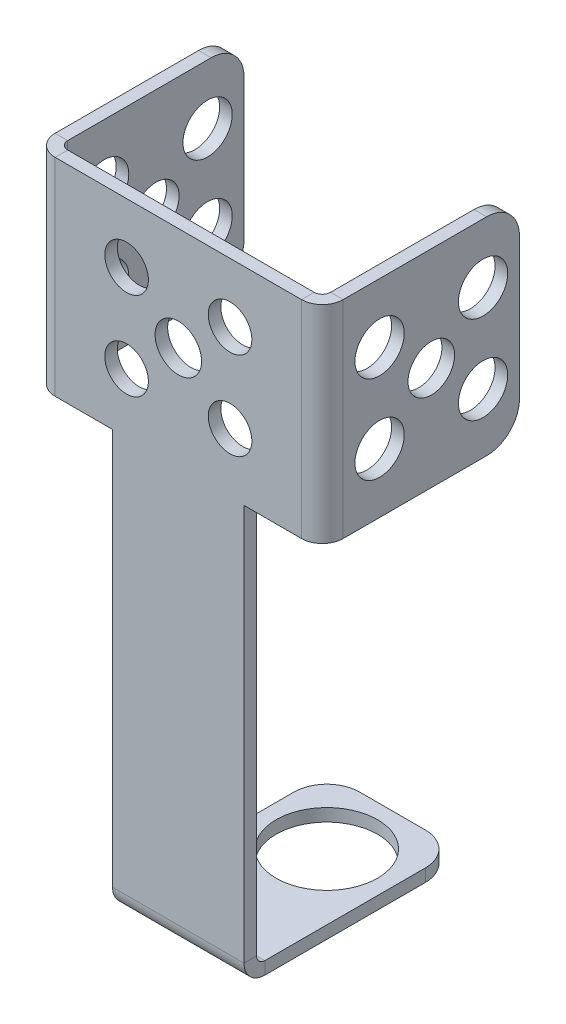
ISO-10303-21;
HEADER;
FILE_DESCRIPTION(('STEP AP214'),'2;1');
FILE_NAME('part.step','',(''),(''),'','','');
FILE_SCHEMA(('AUTOMOTIVE_DESIGN { 1 0 10303 214 1 1 1 1 }'));
ENDSEC;
DATA;
#1=APPLICATION_CONTEXT('core data for automotive mechanical design processes');
#2=APPLICATION_PROTOCOL_DEFINITION('international standard','automotive_design',2000,#1);
#3=PRODUCT_CONTEXT('',#1,'mechanical');
#4=PRODUCT('Part','Part','',(#3));
#5=PRODUCT_RELATED_PRODUCT_CATEGORY('part','',(#4));
#6=PRODUCT_DEFINITION_FORMATION('','',#4);
#7=PRODUCT_DEFINITION_CONTEXT('part definition',#1,'design');
#8=PRODUCT_DEFINITION('design','',#6,#7);
#9=PRODUCT_DEFINITION_SHAPE('','',#8);
#10=(LENGTH_UNIT() NAMED_UNIT(*) SI_UNIT(.MILLI.,.METRE.));
#11=(NAMED_UNIT(*) PLANE_ANGLE_UNIT() SI_UNIT($,.RADIAN.));
#12=(NAMED_UNIT(*) SI_UNIT($,.STERADIAN.) SOLID_ANGLE_UNIT());
#13=UNCERTAINTY_MEASURE_WITH_UNIT(LENGTH_MEASURE(1.E-05),#10,'distance_accuracy_value','');
#14=(GEOMETRIC_REPRESENTATION_CONTEXT(3) GLOBAL_UNCERTAINTY_ASSIGNED_CONTEXT((#13)) GLOBAL_UNIT_ASSIGNED_CONTEXT((#10,
#11,#12)) REPRESENTATION_CONTEXT('',''));
#15=CARTESIAN_POINT('',(0.,0.,0.));
#16=DIRECTION('',(0.,0.,1.));
#17=DIRECTION('',(1.,0.,0.));
#18=AXIS2_PLACEMENT_3D('',#15,#16,#17);
#19=CARTESIAN_POINT('',(6.35,-28.9433,-12.36345));
#20=DIRECTION('',(1.,0.,0.));
#21=DIRECTION('',(0.,0.,-1.));
#22=AXIS2_PLACEMENT_3D('',#19,#20,#21);
#23=PLANE('',#22);
#24=DIRECTION('',(0.,1.,0.));
#25=VECTOR('',#24,1.);
#26=CARTESIAN_POINT('',(6.35,-30.1625,-11.5697));
#27=LINE('',#26,#25);
#28=CARTESIAN_POINT('',(6.35,-28.14955,-11.5697));
#29=VERTEX_POINT('',#28);
#30=CARTESIAN_POINT('',(6.35,10.1625,-11.5697));
#31=VERTEX_POINT('',#30);
#32=EDGE_CURVE('E394',#29,#31,#27,.T.);
#33=ORIENTED_EDGE('',*,*,#32,.T.);
#34=DIRECTION('',(0.,0.,1.));
#35=VECTOR('',#34,1.);
#36=CARTESIAN_POINT('',(6.35,10.1625,-11.5697));
#37=LINE('',#36,#35);
#38=CARTESIAN_POINT('',(6.35,10.1625,-10.3505));
#39=VERTEX_POINT('',#38);
#40=EDGE_CURVE('E378',#31,#39,#37,.T.);
#41=ORIENTED_EDGE('',*,*,#40,.T.);
#42=DIRECTION('',(0.,1.,0.));
#43=VECTOR('',#42,1.);
#44=CARTESIAN_POINT('',(6.35,-30.1625,-10.3505));
#45=LINE('',#44,#43);
#46=CARTESIAN_POINT('',(6.35,-28.14955,-10.3505));
#47=VERTEX_POINT('',#46);
#48=EDGE_CURVE('E397',#47,#39,#45,.T.);
#49=ORIENTED_EDGE('',*,*,#48,.F.);
#50=DIRECTION('',(0.,0.,-1.));
#51=VECTOR('',#50,1.);
#52=CARTESIAN_POINT('',(6.35,-28.14955,-10.3505));
#53=LINE('',#52,#51);
#54=EDGE_CURVE('E453',#47,#29,#53,.T.);
#55=ORIENTED_EDGE('',*,*,#54,.T.);
#56=EDGE_LOOP('',(#33,#41,#49,#55));
#57=FACE_BOUND('',#56,.T.);
#58=ADVANCED_FACE('F79',(#57),#23,.T.);
#59=CARTESIAN_POINT('',(6.35,-28.14955,-10.3505));
#60=DIRECTION('',(1.,0.,0.));
#61=DIRECTION('',(0.,0.,-1.));
#62=AXIS2_PLACEMENT_3D('',#59,#60,#61);
#63=PLANE('',#62);
#64=ORIENTED_EDGE('',*,*,#54,.F.);
#65=CARTESIAN_POINT('',(6.35,-28.14955,-12.36345));
#66=DIRECTION('',(-1.,0.,0.));
#67=DIRECTION('',(0.,0.,1.));
#68=AXIS2_PLACEMENT_3D('',#65,#66,#67);
#69=CIRCLE('',#68,2.01295);
#70=CARTESIAN_POINT('',(6.35,-30.1625,-12.36345));
#71=VERTEX_POINT('',#70);
#72=EDGE_CURVE('E401',#71,#47,#69,.T.);
#73=ORIENTED_EDGE('',*,*,#72,.F.);
#74=DIRECTION('',(0.,-1.,0.));
#75=VECTOR('',#74,1.);
#76=CARTESIAN_POINT('',(6.35,-28.9433,-12.36345));
#77=LINE('',#76,#75);
#78=CARTESIAN_POINT('',(6.35,-28.9433,-12.36345));
#79=VERTEX_POINT('',#78);
#80=EDGE_CURVE('E450',#79,#71,#77,.T.);
#81=ORIENTED_EDGE('',*,*,#80,.F.);
#82=CARTESIAN_POINT('',(6.35,-28.14955,-12.36345));
#83=DIRECTION('',(1.,0.,0.));
#84=DIRECTION('',(0.,0.,-1.));
#85=AXIS2_PLACEMENT_3D('',#82,#83,#84);
#86=CIRCLE('',#85,0.79375);
#87=EDGE_CURVE('E408',#79,#29,#86,.F.);
#88=ORIENTED_EDGE('',*,*,#87,.T.);
#89=EDGE_LOOP('',(#64,#73,#81,#88));
#90=FACE_BOUND('',#89,.T.);
#91=ADVANCED_FACE('F543',(#90),#63,.T.);
#92=CARTESIAN_POINT('',(-6.35,-30.1625,-12.36345));
#93=DIRECTION('',(-1.,0.,0.));
#94=DIRECTION('',(0.,0.,1.));
#95=AXIS2_PLACEMENT_3D('',#92,#93,#94);
#96=PLANE('',#95);
#97=DIRECTION('',(0.,1.,0.));
#98=VECTOR('',#97,1.);
#99=CARTESIAN_POINT('',(-6.35,-30.1625,-12.36345));
#100=LINE('',#99,#98);
#101=CARTESIAN_POINT('',(-6.35,-30.1625,-12.36345));
#102=VERTEX_POINT('',#101);
#103=CARTESIAN_POINT('',(-6.35,-28.9433,-12.36345));
#104=VERTEX_POINT('',#103);
#105=EDGE_CURVE('E447',#102,#104,#100,.T.);
#106=ORIENTED_EDGE('',*,*,#105,.F.);
#107=CARTESIAN_POINT('',(-6.35,-28.14955,-12.36345));
#108=DIRECTION('',(-1.,0.,0.));
#109=DIRECTION('',(0.,0.,1.));
#110=AXIS2_PLACEMENT_3D('',#107,#108,#109);
#111=CIRCLE('',#110,2.01295);
#112=CARTESIAN_POINT('',(-6.35,-28.14955,-10.3505));
#113=VERTEX_POINT('',#112);
#114=EDGE_CURVE('E416',#102,#113,#111,.T.);
#115=ORIENTED_EDGE('',*,*,#114,.T.);
#116=DIRECTION('',(0.,0.,1.));
#117=VECTOR('',#116,1.);
#118=CARTESIAN_POINT('',(-6.35,-28.14955,-11.5697));
#119=LINE('',#118,#117);
#120=CARTESIAN_POINT('',(-6.35,-28.14955,-11.5697));
#121=VERTEX_POINT('',#120);
#122=EDGE_CURVE('E445',#121,#113,#119,.T.);
#123=ORIENTED_EDGE('',*,*,#122,.F.);
#124=CARTESIAN_POINT('',(-6.35,-28.14955,-12.36345));
#125=DIRECTION('',(1.,0.,0.));
#126=DIRECTION('',(0.,0.,-1.));
#127=AXIS2_PLACEMENT_3D('',#124,#125,#126);
#128=CIRCLE('',#127,0.79375);
#129=EDGE_CURVE('E398',#104,#121,#128,.F.);
#130=ORIENTED_EDGE('',*,*,#129,.F.);
#131=EDGE_LOOP('',(#106,#115,#123,#130));
#132=FACE_BOUND('',#131,.T.);
#133=ADVANCED_FACE('F620',(#132),#96,.T.);
#134=CARTESIAN_POINT('',(-6.35,-28.14955,-11.5697));
#135=DIRECTION('',(-1.,0.,0.));
#136=DIRECTION('',(0.,0.,1.));
#137=AXIS2_PLACEMENT_3D('',#134,#135,#136);
#138=PLANE('',#137);
#139=DIRECTION('',(0.,0.,-1.));
#140=VECTOR('',#139,1.);
#141=CARTESIAN_POINT('',(-6.35,-28.9433,-10.3505));
#142=LINE('',#141,#140);
#143=CARTESIAN_POINT('',(-6.35,-28.9433,-27.8765));
#144=VERTEX_POINT('',#143);
#145=EDGE_CURVE('E421',#144,#104,#142,.F.);
#146=ORIENTED_EDGE('',*,*,#145,.F.);
#147=DIRECTION('',(0.,-1.,0.));
#148=VECTOR('',#147,1.);
#149=CARTESIAN_POINT('',(-6.35,-28.14955,-27.8765));
#150=LINE('',#149,#148);
#151=CARTESIAN_POINT('',(-6.35,-30.1625,-27.8765));
#152=VERTEX_POINT('',#151);
#153=EDGE_CURVE('E504',#144,#152,#150,.T.);
#154=ORIENTED_EDGE('',*,*,#153,.T.);
#155=DIRECTION('',(0.,0.,1.));
#156=VECTOR('',#155,1.);
#157=CARTESIAN_POINT('',(-6.35,-30.1625,-10.3505));
#158=LINE('',#157,#156);
#159=EDGE_CURVE('E419',#152,#102,#158,.T.);
#160=ORIENTED_EDGE('',*,*,#159,.T.);
#161=ORIENTED_EDGE('',*,*,#105,.T.);
#162=EDGE_LOOP('',(#146,#154,#160,#161));
#163=FACE_BOUND('',#162,.T.);
#164=ADVANCED_FACE('F524',(#163),#138,.T.);
#165=CARTESIAN_POINT('',(6.35,-30.1625,-11.5697));
#166=DIRECTION('',(0.,0.,1.));
#167=DIRECTION('',(1.,0.,0.));
#168=AXIS2_PLACEMENT_3D('',#165,#166,#167);
#169=PLANE('',#168);
#170=CARTESIAN_POINT('',(5.000000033,15.912499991,-11.5697));
#171=DIRECTION('',(0.,0.,1.));
#172=DIRECTION('',(1.,0.,0.));
#173=AXIS2_PLACEMENT_3D('',#170,#171,#172);
#174=CIRCLE('',#173,2.1082);
#175=CARTESIAN_POINT('',(7.108200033,15.912499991,-11.5697));
#176=VERTEX_POINT('',#175);
#177=EDGE_CURVE('E1282',#176,#176,#174,.T.);
#178=ORIENTED_EDGE('',*,*,#177,.T.);
#179=EDGE_LOOP('',(#178));
#180=FACE_BOUND('',#179,.T.);
#181=CARTESIAN_POINT('',(-5.000000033,24.412500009,-11.5697));
#182=DIRECTION('',(0.,0.,1.));
#183=DIRECTION('',(1.,0.,0.));
#184=AXIS2_PLACEMENT_3D('',#181,#182,#183);
#185=CIRCLE('',#184,2.1082);
#186=CARTESIAN_POINT('',(-2.891800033,24.412500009,-11.5697));
#187=VERTEX_POINT('',#186);
#188=EDGE_CURVE('E1276',#187,#187,#185,.T.);
#189=ORIENTED_EDGE('',*,*,#188,.T.);
#190=EDGE_LOOP('',(#189));
#191=FACE_BOUND('',#190,.T.);
#192=CARTESIAN_POINT('',(-5.000000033,15.912499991,-11.5697));
#193=DIRECTION('',(0.,0.,1.));
#194=DIRECTION('',(1.,0.,0.));
#195=AXIS2_PLACEMENT_3D('',#192,#193,#194);
#196=CIRCLE('',#195,2.1082);
#197=CARTESIAN_POINT('',(-2.891800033,15.912499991,-11.5697));
#198=VERTEX_POINT('',#197);
#199=EDGE_CURVE('E1270',#198,#198,#196,.T.);
#200=ORIENTED_EDGE('',*,*,#199,.T.);
#201=EDGE_LOOP('',(#200));
#202=FACE_BOUND('',#201,.T.);
#203=CARTESIAN_POINT('',(5.000000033,24.412500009,-11.5697));
#204=DIRECTION('',(0.,0.,1.));
#205=DIRECTION('',(1.,0.,0.));
#206=AXIS2_PLACEMENT_3D('',#203,#204,#205);
#207=CIRCLE('',#206,2.1082);
#208=CARTESIAN_POINT('',(7.108200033,24.412500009,-11.5697));
#209=VERTEX_POINT('',#208);
#210=EDGE_CURVE('E1264',#209,#209,#207,.T.);
#211=ORIENTED_EDGE('',*,*,#210,.T.);
#212=EDGE_LOOP('',(#211));
#213=FACE_BOUND('',#212,.T.);
#214=CARTESIAN_POINT('',(0.,20.1625,-11.5697));
#215=DIRECTION('',(0.,0.,1.));
#216=DIRECTION('',(1.,0.,0.));
#217=AXIS2_PLACEMENT_3D('',#214,#215,#216);
#218=CIRCLE('',#217,2.2479);
#219=CARTESIAN_POINT('',(2.2479,20.1625,-11.5697));
#220=VERTEX_POINT('',#219);
#221=EDGE_CURVE('E1258',#220,#220,#218,.T.);
#222=ORIENTED_EDGE('',*,*,#221,.T.);
#223=EDGE_LOOP('',(#222));
#224=FACE_BOUND('',#223,.T.);
#225=DIRECTION('',(0.,1.,0.));
#226=VECTOR('',#225,1.);
#227=CARTESIAN_POINT('',(-6.35,-30.1625,-11.5697));
#228=LINE('',#227,#226);
#229=CARTESIAN_POINT('',(-6.35,10.1625,-11.5697));
#230=VERTEX_POINT('',#229);
#231=EDGE_CURVE('E393',#121,#230,#228,.T.);
#232=ORIENTED_EDGE('',*,*,#231,.T.);
#233=DIRECTION('',(1.,0.,0.));
#234=VECTOR('',#233,1.);
#235=CARTESIAN_POINT('',(-11.90625,10.1625,-11.5697));
#236=LINE('',#235,#234);
#237=CARTESIAN_POINT('',(-11.90625,10.1625,-11.5697));
#238=VERTEX_POINT('',#237);
#239=EDGE_CURVE('E374',#238,#230,#236,.T.);
#240=ORIENTED_EDGE('',*,*,#239,.F.);
#241=DIRECTION('',(0.,1.,0.));
#242=VECTOR('',#241,1.);
#243=CARTESIAN_POINT('',(-11.90625,30.1625,-11.5697));
#244=LINE('',#243,#242);
#245=CARTESIAN_POINT('',(-11.90625,30.1625,-11.5697));
#246=VERTEX_POINT('',#245);
#247=EDGE_CURVE('E313',#246,#238,#244,.F.);
#248=ORIENTED_EDGE('',*,*,#247,.F.);
#249=DIRECTION('',(-1.,0.,0.));
#250=VECTOR('',#249,1.);
#251=CARTESIAN_POINT('',(6.35,30.1625,-11.5697));
#252=LINE('',#251,#250);
#253=CARTESIAN_POINT('',(11.90625,30.1625,-11.5697));
#254=VERTEX_POINT('',#253);
#255=EDGE_CURVE('E442',#254,#246,#252,.T.);
#256=ORIENTED_EDGE('',*,*,#255,.F.);
#257=DIRECTION('',(0.,-1.,0.));
#258=VECTOR('',#257,1.);
#259=CARTESIAN_POINT('',(11.90625,10.1625,-11.5697));
#260=LINE('',#259,#258);
#261=CARTESIAN_POINT('',(11.90625,10.1625,-11.5697));
#262=VERTEX_POINT('',#261);
#263=EDGE_CURVE('E362',#262,#254,#260,.F.);
#264=ORIENTED_EDGE('',*,*,#263,.F.);
#265=DIRECTION('',(-1.,0.,0.));
#266=VECTOR('',#265,1.);
#267=CARTESIAN_POINT('',(11.90625,10.1625,-11.5697));
#268=LINE('',#267,#266);
#269=EDGE_CURVE('E385',#262,#31,#268,.T.);
#270=ORIENTED_EDGE('',*,*,#269,.T.);
#271=ORIENTED_EDGE('',*,*,#32,.F.);
#272=DIRECTION('',(-1.,0.,0.));
#273=VECTOR('',#272,1.);
#274=CARTESIAN_POINT('',(6.35,-28.14955,-11.5697));
#275=LINE('',#274,#273);
#276=EDGE_CURVE('E411',#29,#121,#275,.T.);
#277=ORIENTED_EDGE('',*,*,#276,.T.);
#278=EDGE_LOOP('',(#232,#240,#248,#256,#264,#270,#271,#277));
#279=FACE_BOUND('',#278,.T.);
#280=ADVANCED_FACE('F826',(#180,#191,#202,#213,#224,#279),#169,.F.);
#281=CARTESIAN_POINT('',(6.35,30.1625,-10.3505));
#282=DIRECTION('',(0.,1.,0.));
#283=DIRECTION('',(0.,0.,1.));
#284=AXIS2_PLACEMENT_3D('',#281,#282,#283);
#285=PLANE('',#284);
#286=ORIENTED_EDGE('',*,*,#255,.T.);
#287=DIRECTION('',(0.,0.,1.));
#288=VECTOR('',#287,1.);
#289=CARTESIAN_POINT('',(-11.90625,30.1625,-11.5697));
#290=LINE('',#289,#288);
#291=CARTESIAN_POINT('',(-11.90625,30.1625,-10.3505));
#292=VERTEX_POINT('',#291);
#293=EDGE_CURVE('E309',#246,#292,#290,.T.);
#294=ORIENTED_EDGE('',*,*,#293,.T.);
#295=DIRECTION('',(-1.,0.,0.));
#296=VECTOR('',#295,1.);
#297=CARTESIAN_POINT('',(6.35,30.1625,-10.3505));
#298=LINE('',#297,#296);
#299=CARTESIAN_POINT('',(11.90625,30.1625,-10.3505));
#300=VERTEX_POINT('',#299);
#301=EDGE_CURVE('E440',#300,#292,#298,.T.);
#302=ORIENTED_EDGE('',*,*,#301,.F.);
#303=DIRECTION('',(0.,0.,1.));
#304=VECTOR('',#303,1.);
#305=CARTESIAN_POINT('',(11.90625,30.1625,-11.5697));
#306=LINE('',#305,#304);
#307=EDGE_CURVE('E366',#254,#300,#306,.T.);
#308=ORIENTED_EDGE('',*,*,#307,.F.);
#309=EDGE_LOOP('',(#286,#294,#302,#308));
#310=FACE_BOUND('',#309,.T.);
#311=ADVANCED_FACE('F879',(#310),#285,.T.);
#312=CARTESIAN_POINT('',(6.35,-30.1625,-10.3505));
#313=DIRECTION('',(0.,0.,1.));
#314=DIRECTION('',(1.,0.,0.));
#315=AXIS2_PLACEMENT_3D('',#312,#313,#314);
#316=PLANE('',#315);
#317=CARTESIAN_POINT('',(5.000000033,15.912499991,-10.3505));
#318=DIRECTION('',(0.,0.,1.));
#319=DIRECTION('',(1.,0.,0.));
#320=AXIS2_PLACEMENT_3D('',#317,#318,#319);
#321=CIRCLE('',#320,2.1082);
#322=CARTESIAN_POINT('',(7.108200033,15.912499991,-10.3505));
#323=VERTEX_POINT('',#322);
#324=EDGE_CURVE('E1285',#323,#323,#321,.T.);
#325=ORIENTED_EDGE('',*,*,#324,.F.);
#326=EDGE_LOOP('',(#325));
#327=FACE_BOUND('',#326,.T.);
#328=CARTESIAN_POINT('',(-5.000000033,24.412500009,-10.3505));
#329=DIRECTION('',(0.,0.,1.));
#330=DIRECTION('',(1.,0.,0.));
#331=AXIS2_PLACEMENT_3D('',#328,#329,#330);
#332=CIRCLE('',#331,2.1082);
#333=CARTESIAN_POINT('',(-2.891800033,24.412500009,-10.3505));
#334=VERTEX_POINT('',#333);
#335=EDGE_CURVE('E1279',#334,#334,#332,.T.);
#336=ORIENTED_EDGE('',*,*,#335,.F.);
#337=EDGE_LOOP('',(#336));
#338=FACE_BOUND('',#337,.T.);
#339=CARTESIAN_POINT('',(-5.000000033,15.912499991,-10.3505));
#340=DIRECTION('',(0.,0.,1.));
#341=DIRECTION('',(1.,0.,0.));
#342=AXIS2_PLACEMENT_3D('',#339,#340,#341);
#343=CIRCLE('',#342,2.1082);
#344=CARTESIAN_POINT('',(-2.891800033,15.912499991,-10.3505));
#345=VERTEX_POINT('',#344);
#346=EDGE_CURVE('E1273',#345,#345,#343,.T.);
#347=ORIENTED_EDGE('',*,*,#346,.F.);
#348=EDGE_LOOP('',(#347));
#349=FACE_BOUND('',#348,.T.);
#350=CARTESIAN_POINT('',(5.000000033,24.412500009,-10.3505));
#351=DIRECTION('',(0.,0.,1.));
#352=DIRECTION('',(1.,0.,0.));
#353=AXIS2_PLACEMENT_3D('',#350,#351,#352);
#354=CIRCLE('',#353,2.1082);
#355=CARTESIAN_POINT('',(7.108200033,24.412500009,-10.3505));
#356=VERTEX_POINT('',#355);
#357=EDGE_CURVE('E1267',#356,#356,#354,.T.);
#358=ORIENTED_EDGE('',*,*,#357,.F.);
#359=EDGE_LOOP('',(#358));
#360=FACE_BOUND('',#359,.T.);
#361=CARTESIAN_POINT('',(0.,20.1625,-10.3505));
#362=DIRECTION('',(0.,0.,1.));
#363=DIRECTION('',(1.,0.,0.));
#364=AXIS2_PLACEMENT_3D('',#361,#362,#363);
#365=CIRCLE('',#364,2.2479);
#366=CARTESIAN_POINT('',(2.2479,20.1625,-10.3505));
#367=VERTEX_POINT('',#366);
#368=EDGE_CURVE('E1261',#367,#367,#365,.T.);
#369=ORIENTED_EDGE('',*,*,#368,.F.);
#370=EDGE_LOOP('',(#369));
#371=FACE_BOUND('',#370,.T.);
#372=DIRECTION('',(0.,1.,0.));
#373=VECTOR('',#372,1.);
#374=CARTESIAN_POINT('',(-6.35,-30.1625,-10.3505));
#375=LINE('',#374,#373);
#376=CARTESIAN_POINT('',(-6.35,10.1625,-10.3505));
#377=VERTEX_POINT('',#376);
#378=EDGE_CURVE('E414',#113,#377,#375,.T.);
#379=ORIENTED_EDGE('',*,*,#378,.F.);
#380=DIRECTION('',(-1.,0.,0.));
#381=VECTOR('',#380,1.);
#382=CARTESIAN_POINT('',(6.35,-28.14955,-10.3505));
#383=LINE('',#382,#381);
#384=EDGE_CURVE('E437',#47,#113,#383,.T.);
#385=ORIENTED_EDGE('',*,*,#384,.F.);
#386=ORIENTED_EDGE('',*,*,#48,.T.);
#387=DIRECTION('',(-1.,0.,0.));
#388=VECTOR('',#387,1.);
#389=CARTESIAN_POINT('',(11.90625,10.1625,-10.3505));
#390=LINE('',#389,#388);
#391=CARTESIAN_POINT('',(11.90625,10.1625,-10.3505));
#392=VERTEX_POINT('',#391);
#393=EDGE_CURVE('E383',#392,#39,#390,.T.);
#394=ORIENTED_EDGE('',*,*,#393,.F.);
#395=DIRECTION('',(0.,-1.,0.));
#396=VECTOR('',#395,1.);
#397=CARTESIAN_POINT('',(11.90625,10.1625,-10.3505));
#398=LINE('',#397,#396);
#399=EDGE_CURVE('E349',#392,#300,#398,.F.);
#400=ORIENTED_EDGE('',*,*,#399,.T.);
#401=ORIENTED_EDGE('',*,*,#301,.T.);
#402=DIRECTION('',(0.,1.,0.));
#403=VECTOR('',#402,1.);
#404=CARTESIAN_POINT('',(-11.90625,30.1625,-10.3505));
#405=LINE('',#404,#403);
#406=CARTESIAN_POINT('',(-11.90625,10.1625,-10.3505));
#407=VERTEX_POINT('',#406);
#408=EDGE_CURVE('E260',#292,#407,#405,.F.);
#409=ORIENTED_EDGE('',*,*,#408,.T.);
#410=DIRECTION('',(1.,0.,0.));
#411=VECTOR('',#410,1.);
#412=CARTESIAN_POINT('',(-11.90625,10.1625,-10.3505));
#413=LINE('',#412,#411);
#414=EDGE_CURVE('E375',#407,#377,#413,.T.);
#415=ORIENTED_EDGE('',*,*,#414,.T.);
#416=EDGE_LOOP('',(#379,#385,#386,#394,#400,#401,#409,#415));
#417=FACE_BOUND('',#416,.T.);
#418=ADVANCED_FACE('F551',(#327,#338,#349,#360,#371,#417),#316,.T.);
#419=CARTESIAN_POINT('',(6.35,-28.14955,-12.36345));
#420=DIRECTION('',(-1.,0.,0.));
#421=DIRECTION('',(0.,0.,1.));
#422=AXIS2_PLACEMENT_3D('',#419,#420,#421);
#423=CYLINDRICAL_SURFACE('',#422,2.01295);
#424=ORIENTED_EDGE('',*,*,#114,.F.);
#425=DIRECTION('',(-1.,0.,0.));
#426=VECTOR('',#425,1.);
#427=CARTESIAN_POINT('',(6.35,-30.1625,-12.36345));
#428=LINE('',#427,#426);
#429=EDGE_CURVE('E434',#71,#102,#428,.T.);
#430=ORIENTED_EDGE('',*,*,#429,.F.);
#431=ORIENTED_EDGE('',*,*,#72,.T.);
#432=ORIENTED_EDGE('',*,*,#384,.T.);
#433=EDGE_LOOP('',(#424,#430,#431,#432));
#434=FACE_BOUND('',#433,.T.);
#435=ADVANCED_FACE('F542',(#434),#423,.T.);
#436=CARTESIAN_POINT('',(6.35,-30.1625,-10.3505));
#437=DIRECTION('',(0.,-1.,0.));
#438=DIRECTION('',(0.,0.,-1.));
#439=AXIS2_PLACEMENT_3D('',#436,#437,#438);
#440=PLANE('',#439);
#441=CARTESIAN_POINT('',(0.,-30.1625,-24.7015));
#442=DIRECTION('',(0.,-1.,0.));
#443=DIRECTION('',(0.,0.,-1.));
#444=AXIS2_PLACEMENT_3D('',#441,#442,#443);
#445=CIRCLE('',#444,4.9022);
#446=CARTESIAN_POINT('',(0.,-30.1625,-29.6037));
#447=VERTEX_POINT('',#446);
#448=EDGE_CURVE('E390',#447,#447,#445,.T.);
#449=ORIENTED_EDGE('',*,*,#448,.F.);
#450=EDGE_LOOP('',(#449));
#451=FACE_BOUND('',#450,.T.);
#452=ORIENTED_EDGE('',*,*,#159,.F.);
#453=CARTESIAN_POINT('',(-3.175,-30.1625,-27.8765));
#454=DIRECTION('',(0.,-1.,0.));
#455=DIRECTION('',(0.,0.,-1.));
#456=AXIS2_PLACEMENT_3D('',#453,#454,#455);
#457=CIRCLE('',#456,3.175);
#458=CARTESIAN_POINT('',(-3.175,-30.1625,-31.0515));
#459=VERTEX_POINT('',#458);
#460=EDGE_CURVE('E509',#152,#459,#457,.T.);
#461=ORIENTED_EDGE('',*,*,#460,.T.);
#462=DIRECTION('',(-1.,0.,0.));
#463=VECTOR('',#462,1.);
#464=CARTESIAN_POINT('',(6.35,-30.1625,-31.0515));
#465=LINE('',#464,#463);
#466=CARTESIAN_POINT('',(3.175,-30.1625,-31.0515));
#467=VERTEX_POINT('',#466);
#468=EDGE_CURVE('E432',#467,#459,#465,.T.);
#469=ORIENTED_EDGE('',*,*,#468,.F.);
#470=CARTESIAN_POINT('',(3.175,-30.1625,-27.8765));
#471=DIRECTION('',(0.,-1.,0.));
#472=DIRECTION('',(0.,0.,-1.));
#473=AXIS2_PLACEMENT_3D('',#470,#471,#472);
#474=CIRCLE('',#473,3.175);
#475=CARTESIAN_POINT('',(6.35,-30.1625,-27.8765));
#476=VERTEX_POINT('',#475);
#477=EDGE_CURVE('E507',#467,#476,#474,.T.);
#478=ORIENTED_EDGE('',*,*,#477,.T.);
#479=DIRECTION('',(0.,0.,1.));
#480=VECTOR('',#479,1.);
#481=CARTESIAN_POINT('',(6.35,-30.1625,-10.3505));
#482=LINE('',#481,#480);
#483=EDGE_CURVE('E404',#476,#71,#482,.T.);
#484=ORIENTED_EDGE('',*,*,#483,.T.);
#485=ORIENTED_EDGE('',*,*,#429,.T.);
#486=EDGE_LOOP('',(#452,#461,#469,#478,#484,#485));
#487=FACE_BOUND('',#486,.T.);
#488=ADVANCED_FACE('F530',(#451,#487),#440,.T.);
#489=CARTESIAN_POINT('',(6.35,-28.9433,-31.0515));
#490=DIRECTION('',(0.,0.,-1.));
#491=DIRECTION('',(-1.,0.,0.));
#492=AXIS2_PLACEMENT_3D('',#489,#490,#491);
#493=PLANE('',#492);
#494=ORIENTED_EDGE('',*,*,#468,.T.);
#495=DIRECTION('',(0.,-1.,0.));
#496=VECTOR('',#495,1.);
#497=CARTESIAN_POINT('',(-3.175,-28.9433,-31.0515));
#498=LINE('',#497,#496);
#499=CARTESIAN_POINT('',(-3.175,-28.9433,-31.0515));
#500=VERTEX_POINT('',#499);
#501=EDGE_CURVE('E100',#459,#500,#498,.F.);
#502=ORIENTED_EDGE('',*,*,#501,.T.);
#503=DIRECTION('',(-1.,0.,0.));
#504=VECTOR('',#503,1.);
#505=CARTESIAN_POINT('',(6.35,-28.9433,-31.0515));
#506=LINE('',#505,#504);
#507=CARTESIAN_POINT('',(3.175,-28.9433,-31.0515));
#508=VERTEX_POINT('',#507);
#509=EDGE_CURVE('E430',#508,#500,#506,.T.);
#510=ORIENTED_EDGE('',*,*,#509,.F.);
#511=DIRECTION('',(0.,-1.,0.));
#512=VECTOR('',#511,1.);
#513=CARTESIAN_POINT('',(3.175,-30.1625,-31.0515));
#514=LINE('',#513,#512);
#515=EDGE_CURVE('E511',#508,#467,#514,.T.);
#516=ORIENTED_EDGE('',*,*,#515,.T.);
#517=EDGE_LOOP('',(#494,#502,#510,#516));
#518=FACE_BOUND('',#517,.T.);
#519=ADVANCED_FACE('F531',(#518),#493,.T.);
#520=CARTESIAN_POINT('',(6.35,-28.9433,-10.3505));
#521=DIRECTION('',(0.,-1.,0.));
#522=DIRECTION('',(0.,0.,-1.));
#523=AXIS2_PLACEMENT_3D('',#520,#521,#522);
#524=PLANE('',#523);
#525=CARTESIAN_POINT('',(0.,-28.9433,-24.7015));
#526=DIRECTION('',(0.,1.,0.));
#527=DIRECTION('',(0.,0.,1.));
#528=AXIS2_PLACEMENT_3D('',#525,#526,#527);
#529=CIRCLE('',#528,4.9022);
#530=CARTESIAN_POINT('',(0.,-28.9433,-19.7993));
#531=VERTEX_POINT('',#530);
#532=EDGE_CURVE('E387',#531,#531,#529,.T.);
#533=ORIENTED_EDGE('',*,*,#532,.F.);
#534=EDGE_LOOP('',(#533));
#535=FACE_BOUND('',#534,.T.);
#536=ORIENTED_EDGE('',*,*,#509,.T.);
#537=CARTESIAN_POINT('',(-3.175,-28.9433,-27.8765));
#538=DIRECTION('',(0.,-1.,0.));
#539=DIRECTION('',(0.,0.,-1.));
#540=AXIS2_PLACEMENT_3D('',#537,#538,#539);
#541=CIRCLE('',#540,3.175);
#542=EDGE_CURVE('E87',#500,#144,#541,.F.);
#543=ORIENTED_EDGE('',*,*,#542,.T.);
#544=ORIENTED_EDGE('',*,*,#145,.T.);
#545=DIRECTION('',(-1.,0.,0.));
#546=VECTOR('',#545,1.);
#547=CARTESIAN_POINT('',(6.35,-28.9433,-12.36345));
#548=LINE('',#547,#546);
#549=EDGE_CURVE('E427',#79,#104,#548,.T.);
#550=ORIENTED_EDGE('',*,*,#549,.F.);
#551=DIRECTION('',(0.,0.,-1.));
#552=VECTOR('',#551,1.);
#553=CARTESIAN_POINT('',(6.35,-28.9433,-10.3505));
#554=LINE('',#553,#552);
#555=CARTESIAN_POINT('',(6.35,-28.9433,-27.8765));
#556=VERTEX_POINT('',#555);
#557=EDGE_CURVE('E406',#556,#79,#554,.F.);
#558=ORIENTED_EDGE('',*,*,#557,.F.);
#559=CARTESIAN_POINT('',(3.175,-28.9433,-27.8765));
#560=DIRECTION('',(0.,-1.,0.));
#561=DIRECTION('',(0.,0.,-1.));
#562=AXIS2_PLACEMENT_3D('',#559,#560,#561);
#563=CIRCLE('',#562,3.175);
#564=EDGE_CURVE('E515',#556,#508,#563,.F.);
#565=ORIENTED_EDGE('',*,*,#564,.T.);
#566=EDGE_LOOP('',(#536,#543,#544,#550,#558,#565));
#567=FACE_BOUND('',#566,.T.);
#568=ADVANCED_FACE('F519',(#535,#567),#524,.F.);
#569=CARTESIAN_POINT('',(6.35,-28.14955,-12.36345));
#570=DIRECTION('',(-1.,0.,0.));
#571=DIRECTION('',(0.,0.,1.));
#572=AXIS2_PLACEMENT_3D('',#569,#570,#571);
#573=CYLINDRICAL_SURFACE('',#572,0.79375);
#574=ORIENTED_EDGE('',*,*,#129,.T.);
#575=ORIENTED_EDGE('',*,*,#276,.F.);
#576=ORIENTED_EDGE('',*,*,#87,.F.);
#577=ORIENTED_EDGE('',*,*,#549,.T.);
#578=EDGE_LOOP('',(#574,#575,#576,#577));
#579=FACE_BOUND('',#578,.T.);
#580=ADVANCED_FACE('F781',(#579),#573,.F.);
#581=CARTESIAN_POINT('',(6.35,-28.14955,-12.36345));
#582=DIRECTION('',(-1.,0.,0.));
#583=DIRECTION('',(0.,0.,1.));
#584=AXIS2_PLACEMENT_3D('',#581,#582,#583);
#585=PLANE('',#584);
#586=ORIENTED_EDGE('',*,*,#483,.F.);
#587=DIRECTION('',(0.,-1.,0.));
#588=VECTOR('',#587,1.);
#589=CARTESIAN_POINT('',(6.35,-28.9433,-27.8765));
#590=LINE('',#589,#588);
#591=EDGE_CURVE('E13',#476,#556,#590,.F.);
#592=ORIENTED_EDGE('',*,*,#591,.T.);
#593=ORIENTED_EDGE('',*,*,#557,.T.);
#594=ORIENTED_EDGE('',*,*,#80,.T.);
#595=EDGE_LOOP('',(#586,#592,#593,#594));
#596=FACE_BOUND('',#595,.T.);
#597=ADVANCED_FACE('F535',(#596),#585,.F.);
#598=CARTESIAN_POINT('',(-6.35,-28.14955,-12.36345));
#599=DIRECTION('',(-1.,0.,0.));
#600=DIRECTION('',(0.,0.,1.));
#601=AXIS2_PLACEMENT_3D('',#598,#599,#600);
#602=PLANE('',#601);
#603=DIRECTION('',(0.,0.,1.));
#604=VECTOR('',#603,1.);
#605=CARTESIAN_POINT('',(-6.35,10.1625,-11.5697));
#606=LINE('',#605,#604);
#607=EDGE_CURVE('E369',#230,#377,#606,.T.);
#608=ORIENTED_EDGE('',*,*,#607,.F.);
#609=ORIENTED_EDGE('',*,*,#231,.F.);
#610=ORIENTED_EDGE('',*,*,#122,.T.);
#611=ORIENTED_EDGE('',*,*,#378,.T.);
#612=EDGE_LOOP('',(#608,#609,#610,#611));
#613=FACE_BOUND('',#612,.T.);
#614=ADVANCED_FACE('F780',(#613),#602,.T.);
#615=CARTESIAN_POINT('',(0.,-28.9433,-24.7015));
#616=DIRECTION('',(0.,1.,0.));
#617=DIRECTION('',(0.,0.,1.));
#618=AXIS2_PLACEMENT_3D('',#615,#616,#617);
#619=CYLINDRICAL_SURFACE('',#618,4.9022);
#620=ORIENTED_EDGE('',*,*,#532,.T.);
#621=EDGE_LOOP('',(#620));
#622=FACE_BOUND('',#621,.T.);
#623=ORIENTED_EDGE('',*,*,#448,.T.);
#624=EDGE_LOOP('',(#623));
#625=FACE_BOUND('',#624,.T.);
#626=ADVANCED_FACE('F1078',(#622,#625),#619,.F.);
#627=CARTESIAN_POINT('',(11.90625,10.1625,-11.5697));
#628=DIRECTION('',(0.,-1.,0.));
#629=DIRECTION('',(0.,0.,1.));
#630=AXIS2_PLACEMENT_3D('',#627,#628,#629);
#631=PLANE('',#630);
#632=ORIENTED_EDGE('',*,*,#269,.F.);
#633=DIRECTION('',(0.,0.,1.));
#634=VECTOR('',#633,1.);
#635=CARTESIAN_POINT('',(11.90625,10.1625,-11.5697));
#636=LINE('',#635,#634);
#637=EDGE_CURVE('E356',#262,#392,#636,.T.);
#638=ORIENTED_EDGE('',*,*,#637,.T.);
#639=ORIENTED_EDGE('',*,*,#393,.T.);
#640=ORIENTED_EDGE('',*,*,#40,.F.);
#641=EDGE_LOOP('',(#632,#638,#639,#640));
#642=FACE_BOUND('',#641,.T.);
#643=ADVANCED_FACE('F557',(#642),#631,.T.);
#644=CARTESIAN_POINT('',(-11.90625,10.1625,-11.5697));
#645=DIRECTION('',(0.,1.,0.));
#646=DIRECTION('',(0.,0.,1.));
#647=AXIS2_PLACEMENT_3D('',#644,#645,#646);
#648=PLANE('',#647);
#649=ORIENTED_EDGE('',*,*,#414,.F.);
#650=DIRECTION('',(0.,0.,1.));
#651=VECTOR('',#650,1.);
#652=CARTESIAN_POINT('',(-11.90625,10.1625,-11.5697));
#653=LINE('',#652,#651);
#654=EDGE_CURVE('E316',#238,#407,#653,.T.);
#655=ORIENTED_EDGE('',*,*,#654,.F.);
#656=ORIENTED_EDGE('',*,*,#239,.T.);
#657=ORIENTED_EDGE('',*,*,#607,.T.);
#658=EDGE_LOOP('',(#649,#655,#656,#657));
#659=FACE_BOUND('',#658,.T.);
#660=ADVANCED_FACE('F1058',(#659),#648,.F.);
#661=CARTESIAN_POINT('',(11.90625,30.1625,-12.36345));
#662=DIRECTION('',(0.,1.,0.));
#663=DIRECTION('',(0.,0.,1.));
#664=AXIS2_PLACEMENT_3D('',#661,#662,#663);
#665=PLANE('',#664);
#666=DIRECTION('',(-1.,0.,0.));
#667=VECTOR('',#666,1.);
#668=CARTESIAN_POINT('',(13.9192,30.1625,-12.36345));
#669=LINE('',#668,#667);
#670=CARTESIAN_POINT('',(12.7,30.1625,-12.36345));
#671=VERTEX_POINT('',#670);
#672=CARTESIAN_POINT('',(13.9192,30.1625,-12.36345));
#673=VERTEX_POINT('',#672);
#674=EDGE_CURVE('E319',#671,#673,#669,.F.);
#675=ORIENTED_EDGE('',*,*,#674,.F.);
#676=CARTESIAN_POINT('',(11.90625,30.1625,-12.36345));
#677=DIRECTION('',(0.,-1.,0.));
#678=DIRECTION('',(0.,0.,-1.));
#679=AXIS2_PLACEMENT_3D('',#676,#677,#678);
#680=CIRCLE('',#679,0.793749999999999);
#681=EDGE_CURVE('E359',#254,#671,#680,.F.);
#682=ORIENTED_EDGE('',*,*,#681,.F.);
#683=ORIENTED_EDGE('',*,*,#307,.T.);
#684=CARTESIAN_POINT('',(11.90625,30.1625,-12.36345));
#685=DIRECTION('',(0.,-1.,0.));
#686=DIRECTION('',(0.,0.,-1.));
#687=AXIS2_PLACEMENT_3D('',#684,#685,#686);
#688=CIRCLE('',#687,2.01295);
#689=EDGE_CURVE('E352',#300,#673,#688,.F.);
#690=ORIENTED_EDGE('',*,*,#689,.T.);
#691=EDGE_LOOP('',(#675,#682,#683,#690));
#692=FACE_BOUND('',#691,.T.);
#693=ADVANCED_FACE('F594',(#692),#665,.T.);
#694=CARTESIAN_POINT('',(11.90625,10.1625,-12.36345));
#695=DIRECTION('',(0.,1.,0.));
#696=DIRECTION('',(0.,0.,1.));
#697=AXIS2_PLACEMENT_3D('',#694,#695,#696);
#698=PLANE('',#697);
#699=CARTESIAN_POINT('',(11.90625,10.1625,-12.36345));
#700=DIRECTION('',(0.,-1.,0.));
#701=DIRECTION('',(0.,0.,-1.));
#702=AXIS2_PLACEMENT_3D('',#699,#700,#701);
#703=CIRCLE('',#702,0.793749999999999);
#704=CARTESIAN_POINT('',(12.7,10.1625,-12.36345));
#705=VERTEX_POINT('',#704);
#706=EDGE_CURVE('E324',#705,#262,#703,.T.);
#707=ORIENTED_EDGE('',*,*,#706,.F.);
#708=DIRECTION('',(-1.,0.,0.));
#709=VECTOR('',#708,1.);
#710=CARTESIAN_POINT('',(12.7,10.1625,-12.36345));
#711=LINE('',#710,#709);
#712=CARTESIAN_POINT('',(13.9192,10.1625,-12.36345));
#713=VERTEX_POINT('',#712);
#714=EDGE_CURVE('E342',#705,#713,#711,.F.);
#715=ORIENTED_EDGE('',*,*,#714,.T.);
#716=CARTESIAN_POINT('',(11.90625,10.1625,-12.36345));
#717=DIRECTION('',(0.,-1.,0.));
#718=DIRECTION('',(0.,0.,-1.));
#719=AXIS2_PLACEMENT_3D('',#716,#717,#718);
#720=CIRCLE('',#719,2.01295);
#721=EDGE_CURVE('E353',#713,#392,#720,.T.);
#722=ORIENTED_EDGE('',*,*,#721,.T.);
#723=ORIENTED_EDGE('',*,*,#637,.F.);
#724=EDGE_LOOP('',(#707,#715,#722,#723));
#725=FACE_BOUND('',#724,.T.);
#726=ADVANCED_FACE('F564',(#725),#698,.F.);
#727=CARTESIAN_POINT('',(11.90625,10.1625,-12.36345));
#728=DIRECTION('',(0.,-1.,0.));
#729=DIRECTION('',(1.,0.,0.));
#730=AXIS2_PLACEMENT_3D('',#727,#728,#729);
#731=CYLINDRICAL_SURFACE('',#730,2.01295);
#732=ORIENTED_EDGE('',*,*,#399,.F.);
#733=ORIENTED_EDGE('',*,*,#721,.F.);
#734=DIRECTION('',(0.,-1.,0.));
#735=VECTOR('',#734,1.);
#736=CARTESIAN_POINT('',(13.9192,30.1625,-12.36345));
#737=LINE('',#736,#735);
#738=EDGE_CURVE('E339',#713,#673,#737,.F.);
#739=ORIENTED_EDGE('',*,*,#738,.T.);
#740=ORIENTED_EDGE('',*,*,#689,.F.);
#741=EDGE_LOOP('',(#732,#733,#739,#740));
#742=FACE_BOUND('',#741,.T.);
#743=ADVANCED_FACE('F561',(#742),#731,.T.);
#744=CARTESIAN_POINT('',(11.90625,10.1625,-12.36345));
#745=DIRECTION('',(0.,-1.,0.));
#746=DIRECTION('',(1.,0.,0.));
#747=AXIS2_PLACEMENT_3D('',#744,#745,#746);
#748=CYLINDRICAL_SURFACE('',#747,0.793749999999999);
#749=ORIENTED_EDGE('',*,*,#263,.T.);
#750=ORIENTED_EDGE('',*,*,#681,.T.);
#751=DIRECTION('',(0.,-1.,0.));
#752=VECTOR('',#751,1.);
#753=CARTESIAN_POINT('',(12.7,30.1625,-12.36345));
#754=LINE('',#753,#752);
#755=EDGE_CURVE('E345',#671,#705,#754,.T.);
#756=ORIENTED_EDGE('',*,*,#755,.T.);
#757=ORIENTED_EDGE('',*,*,#706,.T.);
#758=EDGE_LOOP('',(#749,#750,#756,#757));
#759=FACE_BOUND('',#758,.T.);
#760=ADVANCED_FACE('F598',(#759),#748,.F.);
#761=CARTESIAN_POINT('',(13.9192000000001,10.1625,-29.4005));
#762=DIRECTION('',(0.,1.,0.));
#763=DIRECTION('',(0.,0.,1.));
#764=AXIS2_PLACEMENT_3D('',#761,#762,#763);
#765=PLANE('',#764);
#766=DIRECTION('',(0.,0.,1.));
#767=VECTOR('',#766,1.);
#768=CARTESIAN_POINT('',(12.7000000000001,10.1625,-29.4005));
#769=LINE('',#768,#767);
#770=CARTESIAN_POINT('',(12.7,10.1625,-26.2255));
#771=VERTEX_POINT('',#770);
#772=EDGE_CURVE('E336',#705,#771,#769,.F.);
#773=ORIENTED_EDGE('',*,*,#772,.T.);
#774=DIRECTION('',(-1.,0.,0.));
#775=VECTOR('',#774,1.);
#776=CARTESIAN_POINT('',(13.9192,10.1625,-26.2255));
#777=LINE('',#776,#775);
#778=CARTESIAN_POINT('',(13.9192,10.1625,-26.2255));
#779=VERTEX_POINT('',#778);
#780=EDGE_CURVE('E495',#771,#779,#777,.F.);
#781=ORIENTED_EDGE('',*,*,#780,.T.);
#782=DIRECTION('',(0.,0.,-1.));
#783=VECTOR('',#782,1.);
#784=CARTESIAN_POINT('',(13.9192,10.1625,0.));
#785=LINE('',#784,#783);
#786=EDGE_CURVE('E328',#713,#779,#785,.T.);
#787=ORIENTED_EDGE('',*,*,#786,.F.);
#788=ORIENTED_EDGE('',*,*,#714,.F.);
#789=EDGE_LOOP('',(#773,#781,#787,#788));
#790=FACE_BOUND('',#789,.T.);
#791=ADVANCED_FACE('F574',(#790),#765,.F.);
#792=CARTESIAN_POINT('',(13.9192,30.1625,-11.5697));
#793=DIRECTION('',(0.,-1.,0.));
#794=DIRECTION('',(0.,0.,-1.));
#795=AXIS2_PLACEMENT_3D('',#792,#793,#794);
#796=PLANE('',#795);
#797=DIRECTION('',(0.,0.,1.));
#798=VECTOR('',#797,1.);
#799=CARTESIAN_POINT('',(13.9192,30.1625,0.));
#800=LINE('',#799,#798);
#801=CARTESIAN_POINT('',(13.9192,30.1625,-26.2255));
#802=VERTEX_POINT('',#801);
#803=EDGE_CURVE('E322',#802,#673,#800,.T.);
#804=ORIENTED_EDGE('',*,*,#803,.F.);
#805=DIRECTION('',(-1.,0.,0.));
#806=VECTOR('',#805,1.);
#807=CARTESIAN_POINT('',(13.9192,30.1625,-26.2255));
#808=LINE('',#807,#806);
#809=CARTESIAN_POINT('',(12.7,30.1625,-26.2255));
#810=VERTEX_POINT('',#809);
#811=EDGE_CURVE('E501',#802,#810,#808,.T.);
#812=ORIENTED_EDGE('',*,*,#811,.T.);
#813=DIRECTION('',(0.,0.,-1.));
#814=VECTOR('',#813,1.);
#815=CARTESIAN_POINT('',(12.7,30.1625,-11.5697));
#816=LINE('',#815,#814);
#817=EDGE_CURVE('E331',#810,#671,#816,.F.);
#818=ORIENTED_EDGE('',*,*,#817,.T.);
#819=ORIENTED_EDGE('',*,*,#674,.T.);
#820=EDGE_LOOP('',(#804,#812,#818,#819));
#821=FACE_BOUND('',#820,.T.);
#822=ADVANCED_FACE('F589',(#821),#796,.F.);
#823=CARTESIAN_POINT('',(13.9192,0.,0.));
#824=DIRECTION('',(-1.,0.,0.));
#825=DIRECTION('',(0.,0.,1.));
#826=AXIS2_PLACEMENT_3D('',#823,#824,#825);
#827=PLANE('',#826);
#828=CARTESIAN_POINT('',(13.9192000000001,24.4125,-25.8819750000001));
#829=DIRECTION('',(-1.,0.,0.));
#830=DIRECTION('',(0.,0.,1.));
#831=AXIS2_PLACEMENT_3D('',#828,#829,#830);
#832=CIRCLE('',#831,2.38124999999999);
#833=CARTESIAN_POINT('',(13.9192000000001,24.4125,-23.5007250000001));
#834=VERTEX_POINT('',#833);
#835=EDGE_CURVE('E469',#834,#834,#832,.T.);
#836=ORIENTED_EDGE('',*,*,#835,.T.);
#837=EDGE_LOOP('',(#836));
#838=FACE_BOUND('',#837,.T.);
#839=CARTESIAN_POINT('',(13.9192000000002,15.9125,-15.881975));
#840=DIRECTION('',(-1.,0.,0.));
#841=DIRECTION('',(0.,0.,1.));
#842=AXIS2_PLACEMENT_3D('',#839,#840,#841);
#843=CIRCLE('',#842,2.38124999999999);
#844=CARTESIAN_POINT('',(13.9192000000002,15.9125,-13.5007250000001));
#845=VERTEX_POINT('',#844);
#846=EDGE_CURVE('E1245',#845,#845,#843,.T.);
#847=ORIENTED_EDGE('',*,*,#846,.T.);
#848=EDGE_LOOP('',(#847));
#849=FACE_BOUND('',#848,.T.);
#850=CARTESIAN_POINT('',(13.9192000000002,24.4125,-15.8819750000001));
#851=DIRECTION('',(-1.,0.,0.));
#852=DIRECTION('',(0.,0.,1.));
#853=AXIS2_PLACEMENT_3D('',#850,#851,#852);
#854=CIRCLE('',#853,2.38124999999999);
#855=CARTESIAN_POINT('',(13.9192000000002,24.4125,-13.5007250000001));
#856=VERTEX_POINT('',#855);
#857=EDGE_CURVE('E464',#856,#856,#854,.T.);
#858=ORIENTED_EDGE('',*,*,#857,.T.);
#859=EDGE_LOOP('',(#858));
#860=FACE_BOUND('',#859,.T.);
#861=CARTESIAN_POINT('',(13.9192000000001,15.9125,-25.8819750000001));
#862=DIRECTION('',(-1.,0.,0.));
#863=DIRECTION('',(0.,0.,1.));
#864=AXIS2_PLACEMENT_3D('',#861,#862,#863);
#865=CIRCLE('',#864,2.38124999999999);
#866=CARTESIAN_POINT('',(13.9192000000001,15.9125,-23.5007250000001));
#867=VERTEX_POINT('',#866);
#868=EDGE_CURVE('E1226',#867,#867,#865,.T.);
#869=ORIENTED_EDGE('',*,*,#868,.T.);
#870=EDGE_LOOP('',(#869));
#871=FACE_BOUND('',#870,.T.);
#872=CARTESIAN_POINT('',(13.9192000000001,20.1625,-20.8819750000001));
#873=DIRECTION('',(-1.,0.,0.));
#874=DIRECTION('',(0.,0.,1.));
#875=AXIS2_PLACEMENT_3D('',#872,#873,#874);
#876=CIRCLE('',#875,2.24789999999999);
#877=CARTESIAN_POINT('',(13.9192000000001,20.1625,-18.6340750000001));
#878=VERTEX_POINT('',#877);
#879=EDGE_CURVE('E459',#878,#878,#876,.T.);
#880=ORIENTED_EDGE('',*,*,#879,.T.);
#881=EDGE_LOOP('',(#880));
#882=FACE_BOUND('',#881,.T.);
#883=ORIENTED_EDGE('',*,*,#786,.T.);
#884=CARTESIAN_POINT('',(13.9192,13.3375,-26.2255));
#885=DIRECTION('',(-1.,0.,0.));
#886=DIRECTION('',(0.,0.,1.));
#887=AXIS2_PLACEMENT_3D('',#884,#885,#886);
#888=CIRCLE('',#887,3.175);
#889=CARTESIAN_POINT('',(13.9192000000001,13.3375,-29.4005));
#890=VERTEX_POINT('',#889);
#891=EDGE_CURVE('E499',#779,#890,#888,.F.);
#892=ORIENTED_EDGE('',*,*,#891,.T.);
#893=DIRECTION('',(0.,1.,0.));
#894=VECTOR('',#893,1.);
#895=CARTESIAN_POINT('',(13.9192000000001,0.,-29.4005));
#896=LINE('',#895,#894);
#897=CARTESIAN_POINT('',(13.9192000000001,26.9875,-29.4005));
#898=VERTEX_POINT('',#897);
#899=EDGE_CURVE('E325',#890,#898,#896,.T.);
#900=ORIENTED_EDGE('',*,*,#899,.T.);
#901=CARTESIAN_POINT('',(13.9192,26.9875,-26.2255));
#902=DIRECTION('',(-1.,0.,0.));
#903=DIRECTION('',(0.,0.,1.));
#904=AXIS2_PLACEMENT_3D('',#901,#902,#903);
#905=CIRCLE('',#904,3.175);
#906=EDGE_CURVE('E497',#898,#802,#905,.F.);
#907=ORIENTED_EDGE('',*,*,#906,.T.);
#908=ORIENTED_EDGE('',*,*,#803,.T.);
#909=ORIENTED_EDGE('',*,*,#738,.F.);
#910=EDGE_LOOP('',(#883,#892,#900,#907,#908,#909));
#911=FACE_BOUND('',#910,.T.);
#912=ADVANCED_FACE('F571',(#838,#849,#860,#871,#882,#911),#827,.F.);
#913=CARTESIAN_POINT('',(12.7,0.,0.));
#914=DIRECTION('',(-1.,0.,0.));
#915=DIRECTION('',(0.,0.,1.));
#916=AXIS2_PLACEMENT_3D('',#913,#914,#915);
#917=PLANE('',#916);
#918=CARTESIAN_POINT('',(12.7,24.4125,-25.8819750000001));
#919=DIRECTION('',(-1.,0.,0.));
#920=DIRECTION('',(0.,0.,1.));
#921=AXIS2_PLACEMENT_3D('',#918,#919,#920);
#922=CIRCLE('',#921,2.38125);
#923=CARTESIAN_POINT('',(12.7,24.4125,-23.5007250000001));
#924=VERTEX_POINT('',#923);
#925=EDGE_CURVE('E468',#924,#924,#922,.T.);
#926=ORIENTED_EDGE('',*,*,#925,.F.);
#927=EDGE_LOOP('',(#926));
#928=FACE_BOUND('',#927,.T.);
#929=CARTESIAN_POINT('',(12.7,15.9125,-15.881975));
#930=DIRECTION('',(-1.,0.,0.));
#931=DIRECTION('',(0.,0.,1.));
#932=AXIS2_PLACEMENT_3D('',#929,#930,#931);
#933=CIRCLE('',#932,2.38125);
#934=CARTESIAN_POINT('',(12.7,15.9125,-13.500725));
#935=VERTEX_POINT('',#934);
#936=EDGE_CURVE('E1239',#935,#935,#933,.T.);
#937=ORIENTED_EDGE('',*,*,#936,.F.);
#938=EDGE_LOOP('',(#937));
#939=FACE_BOUND('',#938,.T.);
#940=CARTESIAN_POINT('',(12.7,24.4125,-15.8819750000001));
#941=DIRECTION('',(-1.,0.,0.));
#942=DIRECTION('',(0.,0.,1.));
#943=AXIS2_PLACEMENT_3D('',#940,#941,#942);
#944=CIRCLE('',#943,2.38125);
#945=CARTESIAN_POINT('',(12.7,24.4125,-13.5007250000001));
#946=VERTEX_POINT('',#945);
#947=EDGE_CURVE('E463',#946,#946,#944,.T.);
#948=ORIENTED_EDGE('',*,*,#947,.F.);
#949=EDGE_LOOP('',(#948));
#950=FACE_BOUND('',#949,.T.);
#951=CARTESIAN_POINT('',(12.7,15.9125,-25.8819750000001));
#952=DIRECTION('',(-1.,0.,0.));
#953=DIRECTION('',(0.,0.,1.));
#954=AXIS2_PLACEMENT_3D('',#951,#952,#953);
#955=CIRCLE('',#954,2.38125);
#956=CARTESIAN_POINT('',(12.7,15.9125,-23.5007250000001));
#957=VERTEX_POINT('',#956);
#958=EDGE_CURVE('E1210',#957,#957,#955,.T.);
#959=ORIENTED_EDGE('',*,*,#958,.F.);
#960=EDGE_LOOP('',(#959));
#961=FACE_BOUND('',#960,.T.);
#962=CARTESIAN_POINT('',(12.7,20.1625,-20.8819750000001));
#963=DIRECTION('',(-1.,0.,0.));
#964=DIRECTION('',(0.,0.,1.));
#965=AXIS2_PLACEMENT_3D('',#962,#963,#964);
#966=CIRCLE('',#965,2.2479);
#967=CARTESIAN_POINT('',(12.7,20.1625,-18.6340750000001));
#968=VERTEX_POINT('',#967);
#969=EDGE_CURVE('E306',#968,#968,#966,.T.);
#970=ORIENTED_EDGE('',*,*,#969,.F.);
#971=EDGE_LOOP('',(#970));
#972=FACE_BOUND('',#971,.T.);
#973=DIRECTION('',(0.,-1.,0.));
#974=VECTOR('',#973,1.);
#975=CARTESIAN_POINT('',(12.7000000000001,30.1625,-29.4005));
#976=LINE('',#975,#974);
#977=CARTESIAN_POINT('',(12.7000000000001,13.3375,-29.4005));
#978=VERTEX_POINT('',#977);
#979=CARTESIAN_POINT('',(12.7000000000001,26.9875,-29.4005));
#980=VERTEX_POINT('',#979);
#981=EDGE_CURVE('E333',#978,#980,#976,.F.);
#982=ORIENTED_EDGE('',*,*,#981,.F.);
#983=CARTESIAN_POINT('',(12.7,13.3375,-26.2255));
#984=DIRECTION('',(-1.,0.,0.));
#985=DIRECTION('',(0.,0.,1.));
#986=AXIS2_PLACEMENT_3D('',#983,#984,#985);
#987=CIRCLE('',#986,3.175);
#988=EDGE_CURVE('E493',#978,#771,#987,.T.);
#989=ORIENTED_EDGE('',*,*,#988,.T.);
#990=ORIENTED_EDGE('',*,*,#772,.F.);
#991=ORIENTED_EDGE('',*,*,#755,.F.);
#992=ORIENTED_EDGE('',*,*,#817,.F.);
#993=CARTESIAN_POINT('',(12.7,26.9875,-26.2255));
#994=DIRECTION('',(-1.,0.,0.));
#995=DIRECTION('',(0.,0.,1.));
#996=AXIS2_PLACEMENT_3D('',#993,#994,#995);
#997=CIRCLE('',#996,3.175);
#998=EDGE_CURVE('E491',#810,#980,#997,.T.);
#999=ORIENTED_EDGE('',*,*,#998,.T.);
#1000=EDGE_LOOP('',(#982,#989,#990,#991,#992,#999));
#1001=FACE_BOUND('',#1000,.T.);
#1002=ADVANCED_FACE('F600',(#928,#939,#950,#961,#972,#1001),#917,.T.);
#1003=CARTESIAN_POINT('',(13.9192000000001,30.1625,-29.4005));
#1004=DIRECTION('',(0.,0.,1.));
#1005=DIRECTION('',(1.,0.,0.));
#1006=AXIS2_PLACEMENT_3D('',#1003,#1004,#1005);
#1007=PLANE('',#1006);
#1008=ORIENTED_EDGE('',*,*,#899,.F.);
#1009=DIRECTION('',(-1.,0.,0.));
#1010=VECTOR('',#1009,1.);
#1011=CARTESIAN_POINT('',(13.9192000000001,13.3375,-29.4005));
#1012=LINE('',#1011,#1010);
#1013=EDGE_CURVE('E488',#890,#978,#1012,.T.);
#1014=ORIENTED_EDGE('',*,*,#1013,.T.);
#1015=ORIENTED_EDGE('',*,*,#981,.T.);
#1016=DIRECTION('',(-1.,0.,0.));
#1017=VECTOR('',#1016,1.);
#1018=CARTESIAN_POINT('',(13.9192000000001,26.9875,-29.4005));
#1019=LINE('',#1018,#1017);
#1020=EDGE_CURVE('E486',#980,#898,#1019,.F.);
#1021=ORIENTED_EDGE('',*,*,#1020,.T.);
#1022=EDGE_LOOP('',(#1008,#1014,#1015,#1021));
#1023=FACE_BOUND('',#1022,.T.);
#1024=ADVANCED_FACE('F582',(#1023),#1007,.F.);
#1025=CARTESIAN_POINT('',(-11.90625,10.1625,-12.36345));
#1026=DIRECTION('',(0.,-1.,0.));
#1027=DIRECTION('',(0.,0.,-1.));
#1028=AXIS2_PLACEMENT_3D('',#1025,#1026,#1027);
#1029=PLANE('',#1028);
#1030=DIRECTION('',(1.,0.,0.));
#1031=VECTOR('',#1030,1.);
#1032=CARTESIAN_POINT('',(-13.9192,10.1625,-12.36345));
#1033=LINE('',#1032,#1031);
#1034=CARTESIAN_POINT('',(-12.7,10.1625,-12.36345));
#1035=VERTEX_POINT('',#1034);
#1036=CARTESIAN_POINT('',(-13.9192,10.1625,-12.36345));
#1037=VERTEX_POINT('',#1036);
#1038=EDGE_CURVE('E303',#1035,#1037,#1033,.F.);
#1039=ORIENTED_EDGE('',*,*,#1038,.F.);
#1040=CARTESIAN_POINT('',(-11.90625,10.1625,-12.36345));
#1041=DIRECTION('',(0.,1.,0.));
#1042=DIRECTION('',(0.,0.,1.));
#1043=AXIS2_PLACEMENT_3D('',#1040,#1041,#1042);
#1044=CIRCLE('',#1043,0.793749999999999);
#1045=EDGE_CURVE('E263',#238,#1035,#1044,.F.);
#1046=ORIENTED_EDGE('',*,*,#1045,.F.);
#1047=ORIENTED_EDGE('',*,*,#654,.T.);
#1048=CARTESIAN_POINT('',(-11.90625,10.1625,-12.36345));
#1049=DIRECTION('',(0.,1.,0.));
#1050=DIRECTION('',(0.,0.,1.));
#1051=AXIS2_PLACEMENT_3D('',#1048,#1049,#1050);
#1052=CIRCLE('',#1051,2.01295);
#1053=EDGE_CURVE('E308',#407,#1037,#1052,.F.);
#1054=ORIENTED_EDGE('',*,*,#1053,.T.);
#1055=EDGE_LOOP('',(#1039,#1046,#1047,#1054));
#1056=FACE_BOUND('',#1055,.T.);
#1057=ADVANCED_FACE('F608',(#1056),#1029,.T.);
#1058=CARTESIAN_POINT('',(-11.90625,30.1625,-12.36345));
#1059=DIRECTION('',(0.,-1.,0.));
#1060=DIRECTION('',(0.,0.,-1.));
#1061=AXIS2_PLACEMENT_3D('',#1058,#1059,#1060);
#1062=PLANE('',#1061);
#1063=CARTESIAN_POINT('',(-11.90625,30.1625,-12.36345));
#1064=DIRECTION('',(0.,1.,0.));
#1065=DIRECTION('',(0.,0.,1.));
#1066=AXIS2_PLACEMENT_3D('',#1063,#1064,#1065);
#1067=CIRCLE('',#1066,0.793749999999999);
#1068=CARTESIAN_POINT('',(-12.7,30.1625,-12.36345));
#1069=VERTEX_POINT('',#1068);
#1070=EDGE_CURVE('E270',#1069,#246,#1067,.T.);
#1071=ORIENTED_EDGE('',*,*,#1070,.F.);
#1072=DIRECTION('',(1.,0.,0.));
#1073=VECTOR('',#1072,1.);
#1074=CARTESIAN_POINT('',(-12.7,30.1625,-12.36345));
#1075=LINE('',#1074,#1073);
#1076=CARTESIAN_POINT('',(-13.9192,30.1625,-12.36345));
#1077=VERTEX_POINT('',#1076);
#1078=EDGE_CURVE('E267',#1069,#1077,#1075,.F.);
#1079=ORIENTED_EDGE('',*,*,#1078,.T.);
#1080=CARTESIAN_POINT('',(-11.90625,30.1625,-12.36345));
#1081=DIRECTION('',(0.,1.,0.));
#1082=DIRECTION('',(0.,0.,1.));
#1083=AXIS2_PLACEMENT_3D('',#1080,#1081,#1082);
#1084=CIRCLE('',#1083,2.01295);
#1085=EDGE_CURVE('E253',#1077,#292,#1084,.T.);
#1086=ORIENTED_EDGE('',*,*,#1085,.T.);
#1087=ORIENTED_EDGE('',*,*,#293,.F.);
#1088=EDGE_LOOP('',(#1071,#1079,#1086,#1087));
#1089=FACE_BOUND('',#1088,.T.);
#1090=ADVANCED_FACE('F268',(#1089),#1062,.F.);
#1091=CARTESIAN_POINT('',(-11.90625,30.1625,-12.36345));
#1092=DIRECTION('',(0.,1.,0.));
#1093=DIRECTION('',(-1.,0.,0.));
#1094=AXIS2_PLACEMENT_3D('',#1091,#1092,#1093);
#1095=CYLINDRICAL_SURFACE('',#1094,2.01295);
#1096=ORIENTED_EDGE('',*,*,#408,.F.);
#1097=ORIENTED_EDGE('',*,*,#1085,.F.);
#1098=DIRECTION('',(0.,1.,0.));
#1099=VECTOR('',#1098,1.);
#1100=CARTESIAN_POINT('',(-13.9192,10.1625,-12.36345));
#1101=LINE('',#1100,#1099);
#1102=EDGE_CURVE('E257',#1077,#1037,#1101,.F.);
#1103=ORIENTED_EDGE('',*,*,#1102,.T.);
#1104=ORIENTED_EDGE('',*,*,#1053,.F.);
#1105=EDGE_LOOP('',(#1096,#1097,#1103,#1104));
#1106=FACE_BOUND('',#1105,.T.);
#1107=ADVANCED_FACE('F255',(#1106),#1095,.T.);
#1108=CARTESIAN_POINT('',(-11.90625,30.1625,-12.36345));
#1109=DIRECTION('',(0.,1.,0.));
#1110=DIRECTION('',(-1.,0.,0.));
#1111=AXIS2_PLACEMENT_3D('',#1108,#1109,#1110);
#1112=CYLINDRICAL_SURFACE('',#1111,0.793749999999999);
#1113=ORIENTED_EDGE('',*,*,#247,.T.);
#1114=ORIENTED_EDGE('',*,*,#1045,.T.);
#1115=DIRECTION('',(0.,1.,0.));
#1116=VECTOR('',#1115,1.);
#1117=CARTESIAN_POINT('',(-12.7,10.1625,-12.36345));
#1118=LINE('',#1117,#1116);
#1119=EDGE_CURVE('E275',#1035,#1069,#1118,.T.);
#1120=ORIENTED_EDGE('',*,*,#1119,.T.);
#1121=ORIENTED_EDGE('',*,*,#1070,.T.);
#1122=EDGE_LOOP('',(#1113,#1114,#1120,#1121));
#1123=FACE_BOUND('',#1122,.T.);
#1124=ADVANCED_FACE('F727',(#1123),#1112,.F.);
#1125=CARTESIAN_POINT('',(-13.9192,10.1625,-11.5697));
#1126=DIRECTION('',(0.,1.,0.));
#1127=DIRECTION('',(0.,0.,1.));
#1128=AXIS2_PLACEMENT_3D('',#1125,#1126,#1127);
#1129=PLANE('',#1128);
#1130=DIRECTION('',(0.,0.,1.));
#1131=VECTOR('',#1130,1.);
#1132=CARTESIAN_POINT('',(-13.9192,10.1625,0.));
#1133=LINE('',#1132,#1131);
#1134=CARTESIAN_POINT('',(-13.9192,10.1625,-26.2255));
#1135=VERTEX_POINT('',#1134);
#1136=EDGE_CURVE('E284',#1135,#1037,#1133,.T.);
#1137=ORIENTED_EDGE('',*,*,#1136,.F.);
#1138=DIRECTION('',(1.,0.,0.));
#1139=VECTOR('',#1138,1.);
#1140=CARTESIAN_POINT('',(-13.9192,10.1625,-26.2255));
#1141=LINE('',#1140,#1139);
#1142=CARTESIAN_POINT('',(-12.7,10.1625,-26.2255));
#1143=VERTEX_POINT('',#1142);
#1144=EDGE_CURVE('E455',#1135,#1143,#1141,.T.);
#1145=ORIENTED_EDGE('',*,*,#1144,.T.);
#1146=DIRECTION('',(0.,0.,-1.));
#1147=VECTOR('',#1146,1.);
#1148=CARTESIAN_POINT('',(-12.7,10.1625,-11.5697));
#1149=LINE('',#1148,#1147);
#1150=EDGE_CURVE('E285',#1143,#1035,#1149,.F.);
#1151=ORIENTED_EDGE('',*,*,#1150,.T.);
#1152=ORIENTED_EDGE('',*,*,#1038,.T.);
#1153=EDGE_LOOP('',(#1137,#1145,#1151,#1152));
#1154=FACE_BOUND('',#1153,.T.);
#1155=ADVANCED_FACE('F717',(#1154),#1129,.F.);
#1156=CARTESIAN_POINT('',(-13.9192000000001,30.1625,-29.4005));
#1157=DIRECTION('',(0.,-1.,0.));
#1158=DIRECTION('',(0.,0.,-1.));
#1159=AXIS2_PLACEMENT_3D('',#1156,#1157,#1158);
#1160=PLANE('',#1159);
#1161=DIRECTION('',(0.,0.,1.));
#1162=VECTOR('',#1161,1.);
#1163=CARTESIAN_POINT('',(-12.7000000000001,30.1625,-29.4005));
#1164=LINE('',#1163,#1162);
#1165=CARTESIAN_POINT('',(-12.7,30.1625,-26.2255));
#1166=VERTEX_POINT('',#1165);
#1167=EDGE_CURVE('E299',#1069,#1166,#1164,.F.);
#1168=ORIENTED_EDGE('',*,*,#1167,.T.);
#1169=DIRECTION('',(1.,0.,0.));
#1170=VECTOR('',#1169,1.);
#1171=CARTESIAN_POINT('',(-13.9192,30.1625,-26.2255));
#1172=LINE('',#1171,#1170);
#1173=CARTESIAN_POINT('',(-13.9192,30.1625,-26.2255));
#1174=VERTEX_POINT('',#1173);
#1175=EDGE_CURVE('E289',#1166,#1174,#1172,.F.);
#1176=ORIENTED_EDGE('',*,*,#1175,.T.);
#1177=DIRECTION('',(0.,0.,-1.));
#1178=VECTOR('',#1177,1.);
#1179=CARTESIAN_POINT('',(-13.9192,30.1625,0.));
#1180=LINE('',#1179,#1178);
#1181=EDGE_CURVE('E281',#1077,#1174,#1180,.T.);
#1182=ORIENTED_EDGE('',*,*,#1181,.F.);
#1183=ORIENTED_EDGE('',*,*,#1078,.F.);
#1184=EDGE_LOOP('',(#1168,#1176,#1182,#1183));
#1185=FACE_BOUND('',#1184,.T.);
#1186=ADVANCED_FACE('F287',(#1185),#1160,.F.);
#1187=CARTESIAN_POINT('',(-13.9192,0.,0.));
#1188=DIRECTION('',(1.,0.,0.));
#1189=DIRECTION('',(0.,0.,-1.));
#1190=AXIS2_PLACEMENT_3D('',#1187,#1188,#1189);
#1191=PLANE('',#1190);
#1192=CARTESIAN_POINT('',(-13.9192,24.4125,-25.881975));
#1193=DIRECTION('',(-1.,0.,0.));
#1194=DIRECTION('',(0.,0.,1.));
#1195=AXIS2_PLACEMENT_3D('',#1192,#1193,#1194);
#1196=CIRCLE('',#1195,2.38125);
#1197=CARTESIAN_POINT('',(-13.9192,24.4125,-23.500725));
#1198=VERTEX_POINT('',#1197);
#1199=EDGE_CURVE('E1255',#1198,#1198,#1196,.T.);
#1200=ORIENTED_EDGE('',*,*,#1199,.F.);
#1201=EDGE_LOOP('',(#1200));
#1202=FACE_BOUND('',#1201,.T.);
#1203=CARTESIAN_POINT('',(-13.9192,15.9125,-15.881975));
#1204=DIRECTION('',(-1.,0.,0.));
#1205=DIRECTION('',(0.,0.,1.));
#1206=AXIS2_PLACEMENT_3D('',#1203,#1204,#1205);
#1207=CIRCLE('',#1206,2.38125);
#1208=CARTESIAN_POINT('',(-13.9192,15.9125,-13.500725));
#1209=VERTEX_POINT('',#1208);
#1210=EDGE_CURVE('E1248',#1209,#1209,#1207,.T.);
#1211=ORIENTED_EDGE('',*,*,#1210,.F.);
#1212=EDGE_LOOP('',(#1211));
#1213=FACE_BOUND('',#1212,.T.);
#1214=CARTESIAN_POINT('',(-13.9192,24.4125,-15.881975));
#1215=DIRECTION('',(-1.,0.,0.));
#1216=DIRECTION('',(0.,0.,1.));
#1217=AXIS2_PLACEMENT_3D('',#1214,#1215,#1216);
#1218=CIRCLE('',#1217,2.38125);
#1219=CARTESIAN_POINT('',(-13.9192,24.4125,-13.500725));
#1220=VERTEX_POINT('',#1219);
#1221=EDGE_CURVE('E1236',#1220,#1220,#1218,.T.);
#1222=ORIENTED_EDGE('',*,*,#1221,.F.);
#1223=EDGE_LOOP('',(#1222));
#1224=FACE_BOUND('',#1223,.T.);
#1225=CARTESIAN_POINT('',(-13.9192,15.9125,-25.881975));
#1226=DIRECTION('',(-1.,0.,0.));
#1227=DIRECTION('',(0.,0.,1.));
#1228=AXIS2_PLACEMENT_3D('',#1225,#1226,#1227);
#1229=CIRCLE('',#1228,2.38125);
#1230=CARTESIAN_POINT('',(-13.9192,15.9125,-23.500725));
#1231=VERTEX_POINT('',#1230);
#1232=EDGE_CURVE('E1229',#1231,#1231,#1229,.T.);
#1233=ORIENTED_EDGE('',*,*,#1232,.F.);
#1234=EDGE_LOOP('',(#1233));
#1235=FACE_BOUND('',#1234,.T.);
#1236=CARTESIAN_POINT('',(-13.9192,20.1625,-20.881975));
#1237=DIRECTION('',(-1.,0.,0.));
#1238=DIRECTION('',(0.,0.,1.));
#1239=AXIS2_PLACEMENT_3D('',#1236,#1237,#1238);
#1240=CIRCLE('',#1239,2.2479);
#1241=CARTESIAN_POINT('',(-13.9192,20.1625,-18.634075));
#1242=VERTEX_POINT('',#1241);
#1243=EDGE_CURVE('E1208',#1242,#1242,#1240,.T.);
#1244=ORIENTED_EDGE('',*,*,#1243,.F.);
#1245=EDGE_LOOP('',(#1244));
#1246=FACE_BOUND('',#1245,.T.);
#1247=DIRECTION('',(0.,-1.,0.));
#1248=VECTOR('',#1247,1.);
#1249=CARTESIAN_POINT('',(-13.9192000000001,0.,-29.4005));
#1250=LINE('',#1249,#1248);
#1251=CARTESIAN_POINT('',(-13.9192000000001,26.9875,-29.4005));
#1252=VERTEX_POINT('',#1251);
#1253=CARTESIAN_POINT('',(-13.9192000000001,13.3375,-29.4005));
#1254=VERTEX_POINT('',#1253);
#1255=EDGE_CURVE('E290',#1252,#1254,#1250,.T.);
#1256=ORIENTED_EDGE('',*,*,#1255,.T.);
#1257=CARTESIAN_POINT('',(-13.9192,13.3375,-26.2255));
#1258=DIRECTION('',(1.,0.,0.));
#1259=DIRECTION('',(0.,0.,-1.));
#1260=AXIS2_PLACEMENT_3D('',#1257,#1258,#1259);
#1261=CIRCLE('',#1260,3.175);
#1262=EDGE_CURVE('E483',#1254,#1135,#1261,.F.);
#1263=ORIENTED_EDGE('',*,*,#1262,.T.);
#1264=ORIENTED_EDGE('',*,*,#1136,.T.);
#1265=ORIENTED_EDGE('',*,*,#1102,.F.);
#1266=ORIENTED_EDGE('',*,*,#1181,.T.);
#1267=CARTESIAN_POINT('',(-13.9192,26.9875,-26.2255));
#1268=DIRECTION('',(1.,0.,0.));
#1269=DIRECTION('',(0.,0.,-1.));
#1270=AXIS2_PLACEMENT_3D('',#1267,#1268,#1269);
#1271=CIRCLE('',#1270,3.175);
#1272=EDGE_CURVE('E481',#1174,#1252,#1271,.F.);
#1273=ORIENTED_EDGE('',*,*,#1272,.T.);
#1274=EDGE_LOOP('',(#1256,#1263,#1264,#1265,#1266,#1273));
#1275=FACE_BOUND('',#1274,.T.);
#1276=ADVANCED_FACE('F280',(#1202,#1213,#1224,#1235,#1246,#1275),#1191,.F.);
#1277=CARTESIAN_POINT('',(-12.7,0.,0.));
#1278=DIRECTION('',(1.,0.,0.));
#1279=DIRECTION('',(0.,0.,-1.));
#1280=AXIS2_PLACEMENT_3D('',#1277,#1278,#1279);
#1281=PLANE('',#1280);
#1282=CARTESIAN_POINT('',(-12.7,24.4125,-25.881975));
#1283=DIRECTION('',(1.,0.,0.));
#1284=DIRECTION('',(0.,0.,-1.));
#1285=AXIS2_PLACEMENT_3D('',#1282,#1283,#1284);
#1286=CIRCLE('',#1285,2.38125);
#1287=CARTESIAN_POINT('',(-12.7000000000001,24.4125,-28.263225));
#1288=VERTEX_POINT('',#1287);
#1289=EDGE_CURVE('E465',#1288,#1288,#1286,.T.);
#1290=ORIENTED_EDGE('',*,*,#1289,.F.);
#1291=EDGE_LOOP('',(#1290));
#1292=FACE_BOUND('',#1291,.T.);
#1293=CARTESIAN_POINT('',(-12.7,15.9125,-15.881975));
#1294=DIRECTION('',(1.,0.,0.));
#1295=DIRECTION('',(0.,0.,-1.));
#1296=AXIS2_PLACEMENT_3D('',#1293,#1294,#1295);
#1297=CIRCLE('',#1296,2.38125);
#1298=CARTESIAN_POINT('',(-12.7,15.9125,-18.263225));
#1299=VERTEX_POINT('',#1298);
#1300=EDGE_CURVE('E1242',#1299,#1299,#1297,.T.);
#1301=ORIENTED_EDGE('',*,*,#1300,.F.);
#1302=EDGE_LOOP('',(#1301));
#1303=FACE_BOUND('',#1302,.T.);
#1304=CARTESIAN_POINT('',(-12.7,24.4125,-15.881975));
#1305=DIRECTION('',(1.,0.,0.));
#1306=DIRECTION('',(0.,0.,-1.));
#1307=AXIS2_PLACEMENT_3D('',#1304,#1305,#1306);
#1308=CIRCLE('',#1307,2.38125);
#1309=CARTESIAN_POINT('',(-12.7,24.4125,-18.263225));
#1310=VERTEX_POINT('',#1309);
#1311=EDGE_CURVE('E460',#1310,#1310,#1308,.T.);
#1312=ORIENTED_EDGE('',*,*,#1311,.F.);
#1313=EDGE_LOOP('',(#1312));
#1314=FACE_BOUND('',#1313,.T.);
#1315=CARTESIAN_POINT('',(-12.7,15.9125,-25.881975));
#1316=DIRECTION('',(1.,0.,0.));
#1317=DIRECTION('',(0.,0.,-1.));
#1318=AXIS2_PLACEMENT_3D('',#1315,#1316,#1317);
#1319=CIRCLE('',#1318,2.38125);
#1320=CARTESIAN_POINT('',(-12.7000000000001,15.9125,-28.263225));
#1321=VERTEX_POINT('',#1320);
#1322=EDGE_CURVE('E1215',#1321,#1321,#1319,.T.);
#1323=ORIENTED_EDGE('',*,*,#1322,.F.);
#1324=EDGE_LOOP('',(#1323));
#1325=FACE_BOUND('',#1324,.T.);
#1326=CARTESIAN_POINT('',(-12.7,20.1625,-20.881975));
#1327=DIRECTION('',(1.,0.,0.));
#1328=DIRECTION('',(0.,0.,-1.));
#1329=AXIS2_PLACEMENT_3D('',#1326,#1327,#1328);
#1330=CIRCLE('',#1329,2.2479);
#1331=CARTESIAN_POINT('',(-12.7,20.1625,-23.129875));
#1332=VERTEX_POINT('',#1331);
#1333=EDGE_CURVE('E456',#1332,#1332,#1330,.T.);
#1334=ORIENTED_EDGE('',*,*,#1333,.F.);
#1335=EDGE_LOOP('',(#1334));
#1336=FACE_BOUND('',#1335,.T.);
#1337=ORIENTED_EDGE('',*,*,#1150,.F.);
#1338=CARTESIAN_POINT('',(-12.7,13.3375,-26.2255));
#1339=DIRECTION('',(1.,0.,0.));
#1340=DIRECTION('',(0.,0.,-1.));
#1341=AXIS2_PLACEMENT_3D('',#1338,#1339,#1340);
#1342=CIRCLE('',#1341,3.175);
#1343=CARTESIAN_POINT('',(-12.7000000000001,13.3375,-29.4005));
#1344=VERTEX_POINT('',#1343);
#1345=EDGE_CURVE('E474',#1143,#1344,#1342,.T.);
#1346=ORIENTED_EDGE('',*,*,#1345,.T.);
#1347=DIRECTION('',(0.,1.,0.));
#1348=VECTOR('',#1347,1.);
#1349=CARTESIAN_POINT('',(-12.7000000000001,10.1625,-29.4005));
#1350=LINE('',#1349,#1348);
#1351=CARTESIAN_POINT('',(-12.7000000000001,26.9875,-29.4005));
#1352=VERTEX_POINT('',#1351);
#1353=EDGE_CURVE('E293',#1352,#1344,#1350,.F.);
#1354=ORIENTED_EDGE('',*,*,#1353,.F.);
#1355=CARTESIAN_POINT('',(-12.7,26.9875,-26.2255));
#1356=DIRECTION('',(1.,0.,0.));
#1357=DIRECTION('',(0.,0.,-1.));
#1358=AXIS2_PLACEMENT_3D('',#1355,#1356,#1357);
#1359=CIRCLE('',#1358,3.175);
#1360=EDGE_CURVE('E472',#1352,#1166,#1359,.T.);
#1361=ORIENTED_EDGE('',*,*,#1360,.T.);
#1362=ORIENTED_EDGE('',*,*,#1167,.F.);
#1363=ORIENTED_EDGE('',*,*,#1119,.F.);
#1364=EDGE_LOOP('',(#1337,#1346,#1354,#1361,#1362,#1363));
#1365=FACE_BOUND('',#1364,.T.);
#1366=ADVANCED_FACE('F684',(#1292,#1303,#1314,#1325,#1336,#1365),#1281,.T.);
#1367=CARTESIAN_POINT('',(-13.9192000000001,10.1625,-29.4005));
#1368=DIRECTION('',(0.,0.,1.));
#1369=DIRECTION('',(1.,0.,0.));
#1370=AXIS2_PLACEMENT_3D('',#1367,#1368,#1369);
#1371=PLANE('',#1370);
#1372=ORIENTED_EDGE('',*,*,#1353,.T.);
#1373=DIRECTION('',(1.,0.,0.));
#1374=VECTOR('',#1373,1.);
#1375=CARTESIAN_POINT('',(-13.9192000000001,13.3375,-29.4005));
#1376=LINE('',#1375,#1374);
#1377=EDGE_CURVE('E479',#1344,#1254,#1376,.F.);
#1378=ORIENTED_EDGE('',*,*,#1377,.T.);
#1379=ORIENTED_EDGE('',*,*,#1255,.F.);
#1380=DIRECTION('',(1.,0.,0.));
#1381=VECTOR('',#1380,1.);
#1382=CARTESIAN_POINT('',(-13.9192000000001,26.9875,-29.4005));
#1383=LINE('',#1382,#1381);
#1384=EDGE_CURVE('E476',#1252,#1352,#1383,.T.);
#1385=ORIENTED_EDGE('',*,*,#1384,.T.);
#1386=EDGE_LOOP('',(#1372,#1378,#1379,#1385));
#1387=FACE_BOUND('',#1386,.T.);
#1388=ADVANCED_FACE('F678',(#1387),#1371,.F.);
#1389=CARTESIAN_POINT('',(-13.9192,20.1625,-20.881975));
#1390=DIRECTION('',(-1.,0.,0.));
#1391=DIRECTION('',(0.,0.,1.));
#1392=AXIS2_PLACEMENT_3D('',#1389,#1390,#1391);
#1393=CYLINDRICAL_SURFACE('',#1392,2.2479);
#1394=ORIENTED_EDGE('',*,*,#1333,.T.);
#1395=EDGE_LOOP('',(#1394));
#1396=FACE_BOUND('',#1395,.T.);
#1397=ORIENTED_EDGE('',*,*,#1243,.T.);
#1398=EDGE_LOOP('',(#1397));
#1399=FACE_BOUND('',#1398,.T.);
#1400=ADVANCED_FACE('F683',(#1396,#1399),#1393,.F.);
#1401=ORIENTED_EDGE('',*,*,#969,.T.);
#1402=EDGE_LOOP('',(#1401));
#1403=FACE_BOUND('',#1402,.T.);
#1404=ORIENTED_EDGE('',*,*,#879,.F.);
#1405=EDGE_LOOP('',(#1404));
#1406=FACE_BOUND('',#1405,.T.);
#1407=ADVANCED_FACE('F975',(#1403,#1406),#1393,.F.);
#1408=CARTESIAN_POINT('',(-13.9192,15.9125,-25.881975));
#1409=DIRECTION('',(-1.,0.,0.));
#1410=DIRECTION('',(0.,0.,1.));
#1411=AXIS2_PLACEMENT_3D('',#1408,#1409,#1410);
#1412=CYLINDRICAL_SURFACE('',#1411,2.38125);
#1413=ORIENTED_EDGE('',*,*,#1322,.T.);
#1414=EDGE_LOOP('',(#1413));
#1415=FACE_BOUND('',#1414,.T.);
#1416=ORIENTED_EDGE('',*,*,#1232,.T.);
#1417=EDGE_LOOP('',(#1416));
#1418=FACE_BOUND('',#1417,.T.);
#1419=ADVANCED_FACE('F965',(#1415,#1418),#1412,.F.);
#1420=ORIENTED_EDGE('',*,*,#958,.T.);
#1421=EDGE_LOOP('',(#1420));
#1422=FACE_BOUND('',#1421,.T.);
#1423=ORIENTED_EDGE('',*,*,#868,.F.);
#1424=EDGE_LOOP('',(#1423));
#1425=FACE_BOUND('',#1424,.T.);
#1426=ADVANCED_FACE('F956',(#1422,#1425),#1412,.F.);
#1427=CARTESIAN_POINT('',(-13.9192,24.4125,-15.881975));
#1428=DIRECTION('',(-1.,0.,0.));
#1429=DIRECTION('',(0.,0.,1.));
#1430=AXIS2_PLACEMENT_3D('',#1427,#1428,#1429);
#1431=CYLINDRICAL_SURFACE('',#1430,2.38125);
#1432=ORIENTED_EDGE('',*,*,#1311,.T.);
#1433=EDGE_LOOP('',(#1432));
#1434=FACE_BOUND('',#1433,.T.);
#1435=ORIENTED_EDGE('',*,*,#1221,.T.);
#1436=EDGE_LOOP('',(#1435));
#1437=FACE_BOUND('',#1436,.T.);
#1438=ADVANCED_FACE('F946',(#1434,#1437),#1431,.F.);
#1439=ORIENTED_EDGE('',*,*,#947,.T.);
#1440=EDGE_LOOP('',(#1439));
#1441=FACE_BOUND('',#1440,.T.);
#1442=ORIENTED_EDGE('',*,*,#857,.F.);
#1443=EDGE_LOOP('',(#1442));
#1444=FACE_BOUND('',#1443,.T.);
#1445=ADVANCED_FACE('F937',(#1441,#1444),#1431,.F.);
#1446=CARTESIAN_POINT('',(-13.9192,15.9125,-15.881975));
#1447=DIRECTION('',(-1.,0.,0.));
#1448=DIRECTION('',(0.,0.,1.));
#1449=AXIS2_PLACEMENT_3D('',#1446,#1447,#1448);
#1450=CYLINDRICAL_SURFACE('',#1449,2.38125);
#1451=ORIENTED_EDGE('',*,*,#1300,.T.);
#1452=EDGE_LOOP('',(#1451));
#1453=FACE_BOUND('',#1452,.T.);
#1454=ORIENTED_EDGE('',*,*,#1210,.T.);
#1455=EDGE_LOOP('',(#1454));
#1456=FACE_BOUND('',#1455,.T.);
#1457=ADVANCED_FACE('F927',(#1453,#1456),#1450,.F.);
#1458=ORIENTED_EDGE('',*,*,#936,.T.);
#1459=EDGE_LOOP('',(#1458));
#1460=FACE_BOUND('',#1459,.T.);
#1461=ORIENTED_EDGE('',*,*,#846,.F.);
#1462=EDGE_LOOP('',(#1461));
#1463=FACE_BOUND('',#1462,.T.);
#1464=ADVANCED_FACE('F918',(#1460,#1463),#1450,.F.);
#1465=CARTESIAN_POINT('',(-13.9192,24.4125,-25.881975));
#1466=DIRECTION('',(-1.,0.,0.));
#1467=DIRECTION('',(0.,0.,1.));
#1468=AXIS2_PLACEMENT_3D('',#1465,#1466,#1467);
#1469=CYLINDRICAL_SURFACE('',#1468,2.38125);
#1470=ORIENTED_EDGE('',*,*,#1289,.T.);
#1471=EDGE_LOOP('',(#1470));
#1472=FACE_BOUND('',#1471,.T.);
#1473=ORIENTED_EDGE('',*,*,#1199,.T.);
#1474=EDGE_LOOP('',(#1473));
#1475=FACE_BOUND('',#1474,.T.);
#1476=ADVANCED_FACE('F908',(#1472,#1475),#1469,.F.);
#1477=ORIENTED_EDGE('',*,*,#925,.T.);
#1478=EDGE_LOOP('',(#1477));
#1479=FACE_BOUND('',#1478,.T.);
#1480=ORIENTED_EDGE('',*,*,#835,.F.);
#1481=EDGE_LOOP('',(#1480));
#1482=FACE_BOUND('',#1481,.T.);
#1483=ADVANCED_FACE('F898',(#1479,#1482),#1469,.F.);
#1484=CARTESIAN_POINT('',(0.,20.1625,-10.3505));
#1485=DIRECTION('',(0.,0.,1.));
#1486=DIRECTION('',(1.,0.,0.));
#1487=AXIS2_PLACEMENT_3D('',#1484,#1485,#1486);
#1488=CYLINDRICAL_SURFACE('',#1487,2.2479);
#1489=ORIENTED_EDGE('',*,*,#221,.F.);
#1490=EDGE_LOOP('',(#1489));
#1491=FACE_BOUND('',#1490,.T.);
#1492=ORIENTED_EDGE('',*,*,#368,.T.);
#1493=EDGE_LOOP('',(#1492));
#1494=FACE_BOUND('',#1493,.T.);
#1495=ADVANCED_FACE('F867',(#1491,#1494),#1488,.F.);
#1496=CARTESIAN_POINT('',(5.000000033,24.412500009,-10.3505));
#1497=DIRECTION('',(0.,0.,1.));
#1498=DIRECTION('',(1.,0.,0.));
#1499=AXIS2_PLACEMENT_3D('',#1496,#1497,#1498);
#1500=CYLINDRICAL_SURFACE('',#1499,2.1082);
#1501=ORIENTED_EDGE('',*,*,#210,.F.);
#1502=EDGE_LOOP('',(#1501));
#1503=FACE_BOUND('',#1502,.T.);
#1504=ORIENTED_EDGE('',*,*,#357,.T.);
#1505=EDGE_LOOP('',(#1504));
#1506=FACE_BOUND('',#1505,.T.);
#1507=ADVANCED_FACE('F857',(#1503,#1506),#1500,.F.);
#1508=CARTESIAN_POINT('',(-5.000000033,15.912499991,-10.3505));
#1509=DIRECTION('',(0.,0.,1.));
#1510=DIRECTION('',(1.,0.,0.));
#1511=AXIS2_PLACEMENT_3D('',#1508,#1509,#1510);
#1512=CYLINDRICAL_SURFACE('',#1511,2.1082);
#1513=ORIENTED_EDGE('',*,*,#199,.F.);
#1514=EDGE_LOOP('',(#1513));
#1515=FACE_BOUND('',#1514,.T.);
#1516=ORIENTED_EDGE('',*,*,#346,.T.);
#1517=EDGE_LOOP('',(#1516));
#1518=FACE_BOUND('',#1517,.T.);
#1519=ADVANCED_FACE('F847',(#1515,#1518),#1512,.F.);
#1520=CARTESIAN_POINT('',(-5.000000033,24.412500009,-10.3505));
#1521=DIRECTION('',(0.,0.,1.));
#1522=DIRECTION('',(1.,0.,0.));
#1523=AXIS2_PLACEMENT_3D('',#1520,#1521,#1522);
#1524=CYLINDRICAL_SURFACE('',#1523,2.1082);
#1525=ORIENTED_EDGE('',*,*,#188,.F.);
#1526=EDGE_LOOP('',(#1525));
#1527=FACE_BOUND('',#1526,.T.);
#1528=ORIENTED_EDGE('',*,*,#335,.T.);
#1529=EDGE_LOOP('',(#1528));
#1530=FACE_BOUND('',#1529,.T.);
#1531=ADVANCED_FACE('F837',(#1527,#1530),#1524,.F.);
#1532=CARTESIAN_POINT('',(5.000000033,15.912499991,-10.3505));
#1533=DIRECTION('',(0.,0.,1.));
#1534=DIRECTION('',(1.,0.,0.));
#1535=AXIS2_PLACEMENT_3D('',#1532,#1533,#1534);
#1536=CYLINDRICAL_SURFACE('',#1535,2.1082);
#1537=ORIENTED_EDGE('',*,*,#177,.F.);
#1538=EDGE_LOOP('',(#1537));
#1539=FACE_BOUND('',#1538,.T.);
#1540=ORIENTED_EDGE('',*,*,#324,.T.);
#1541=EDGE_LOOP('',(#1540));
#1542=FACE_BOUND('',#1541,.T.);
#1543=ADVANCED_FACE('F629',(#1539,#1542),#1536,.F.);
#1544=CARTESIAN_POINT('',(-13.9192,13.3375,-26.2255));
#1545=DIRECTION('',(1.,0.,0.));
#1546=DIRECTION('',(0.,0.,-1.));
#1547=AXIS2_PLACEMENT_3D('',#1544,#1545,#1546);
#1548=CYLINDRICAL_SURFACE('',#1547,3.175);
#1549=ORIENTED_EDGE('',*,*,#1262,.F.);
#1550=ORIENTED_EDGE('',*,*,#1377,.F.);
#1551=ORIENTED_EDGE('',*,*,#1345,.F.);
#1552=ORIENTED_EDGE('',*,*,#1144,.F.);
#1553=EDGE_LOOP('',(#1549,#1550,#1551,#1552));
#1554=FACE_BOUND('',#1553,.T.);
#1555=ADVANCED_FACE('F625',(#1554),#1548,.T.);
#1556=CARTESIAN_POINT('',(-13.9192,26.9875,-26.2255));
#1557=DIRECTION('',(1.,0.,0.));
#1558=DIRECTION('',(0.,0.,-1.));
#1559=AXIS2_PLACEMENT_3D('',#1556,#1557,#1558);
#1560=CYLINDRICAL_SURFACE('',#1559,3.175);
#1561=ORIENTED_EDGE('',*,*,#1272,.F.);
#1562=ORIENTED_EDGE('',*,*,#1175,.F.);
#1563=ORIENTED_EDGE('',*,*,#1360,.F.);
#1564=ORIENTED_EDGE('',*,*,#1384,.F.);
#1565=EDGE_LOOP('',(#1561,#1562,#1563,#1564));
#1566=FACE_BOUND('',#1565,.T.);
#1567=ADVANCED_FACE('F628',(#1566),#1560,.T.);
#1568=CARTESIAN_POINT('',(13.9192,13.3375,-26.2255));
#1569=DIRECTION('',(-1.,0.,0.));
#1570=DIRECTION('',(0.,0.,1.));
#1571=AXIS2_PLACEMENT_3D('',#1568,#1569,#1570);
#1572=CYLINDRICAL_SURFACE('',#1571,3.175);
#1573=ORIENTED_EDGE('',*,*,#891,.F.);
#1574=ORIENTED_EDGE('',*,*,#780,.F.);
#1575=ORIENTED_EDGE('',*,*,#988,.F.);
#1576=ORIENTED_EDGE('',*,*,#1013,.F.);
#1577=EDGE_LOOP('',(#1573,#1574,#1575,#1576));
#1578=FACE_BOUND('',#1577,.T.);
#1579=ADVANCED_FACE('F577',(#1578),#1572,.T.);
#1580=CARTESIAN_POINT('',(13.9192,26.9875,-26.2255));
#1581=DIRECTION('',(-1.,0.,0.));
#1582=DIRECTION('',(0.,0.,1.));
#1583=AXIS2_PLACEMENT_3D('',#1580,#1581,#1582);
#1584=CYLINDRICAL_SURFACE('',#1583,3.175);
#1585=ORIENTED_EDGE('',*,*,#906,.F.);
#1586=ORIENTED_EDGE('',*,*,#1020,.F.);
#1587=ORIENTED_EDGE('',*,*,#998,.F.);
#1588=ORIENTED_EDGE('',*,*,#811,.F.);
#1589=EDGE_LOOP('',(#1585,#1586,#1587,#1588));
#1590=FACE_BOUND('',#1589,.T.);
#1591=ADVANCED_FACE('F586',(#1590),#1584,.T.);
#1592=CARTESIAN_POINT('',(-3.175,-28.14955,-27.8765));
#1593=DIRECTION('',(0.,-1.,0.));
#1594=DIRECTION('',(0.,0.,-1.));
#1595=AXIS2_PLACEMENT_3D('',#1592,#1593,#1594);
#1596=CYLINDRICAL_SURFACE('',#1595,3.175);
#1597=ORIENTED_EDGE('',*,*,#542,.F.);
#1598=ORIENTED_EDGE('',*,*,#501,.F.);
#1599=ORIENTED_EDGE('',*,*,#460,.F.);
#1600=ORIENTED_EDGE('',*,*,#153,.F.);
#1601=EDGE_LOOP('',(#1597,#1598,#1599,#1600));
#1602=FACE_BOUND('',#1601,.T.);
#1603=ADVANCED_FACE('F527',(#1602),#1596,.T.);
#1604=CARTESIAN_POINT('',(3.175,-28.9433,-27.8765));
#1605=DIRECTION('',(0.,1.,0.));
#1606=DIRECTION('',(0.,0.,1.));
#1607=AXIS2_PLACEMENT_3D('',#1604,#1605,#1606);
#1608=CYLINDRICAL_SURFACE('',#1607,3.175);
#1609=ORIENTED_EDGE('',*,*,#564,.F.);
#1610=ORIENTED_EDGE('',*,*,#591,.F.);
#1611=ORIENTED_EDGE('',*,*,#477,.F.);
#1612=ORIENTED_EDGE('',*,*,#515,.F.);
#1613=EDGE_LOOP('',(#1609,#1610,#1611,#1612));
#1614=FACE_BOUND('',#1613,.T.);
#1615=ADVANCED_FACE('F81',(#1614),#1608,.T.);
#1616=CLOSED_SHELL('',(#58,#91,#133,#164,#280,#311,#418,#435,#488,#519,#568,#580,#597,#614,#626,
#643,#660,#693,#726,#743,#760,#791,#822,#912,#1002,#1024,#1057,#1090,#1107,#1124,#1155,#1186,
#1276,#1366,#1388,#1400,#1407,#1419,#1426,#1438,#1445,#1457,#1464,#1476,#1483,#1495,#1507,#1519,
#1531,#1543,#1555,#1567,#1579,#1591,#1603,#1615));
#1617=MANIFOLD_SOLID_BREP('B2',#1616);
#1618=ADVANCED_BREP_SHAPE_REPRESENTATION('',(#18,#1617),#14);
#1619=SHAPE_DEFINITION_REPRESENTATION(#9,#1618);
ENDSEC;
END-ISO-10303-21;
